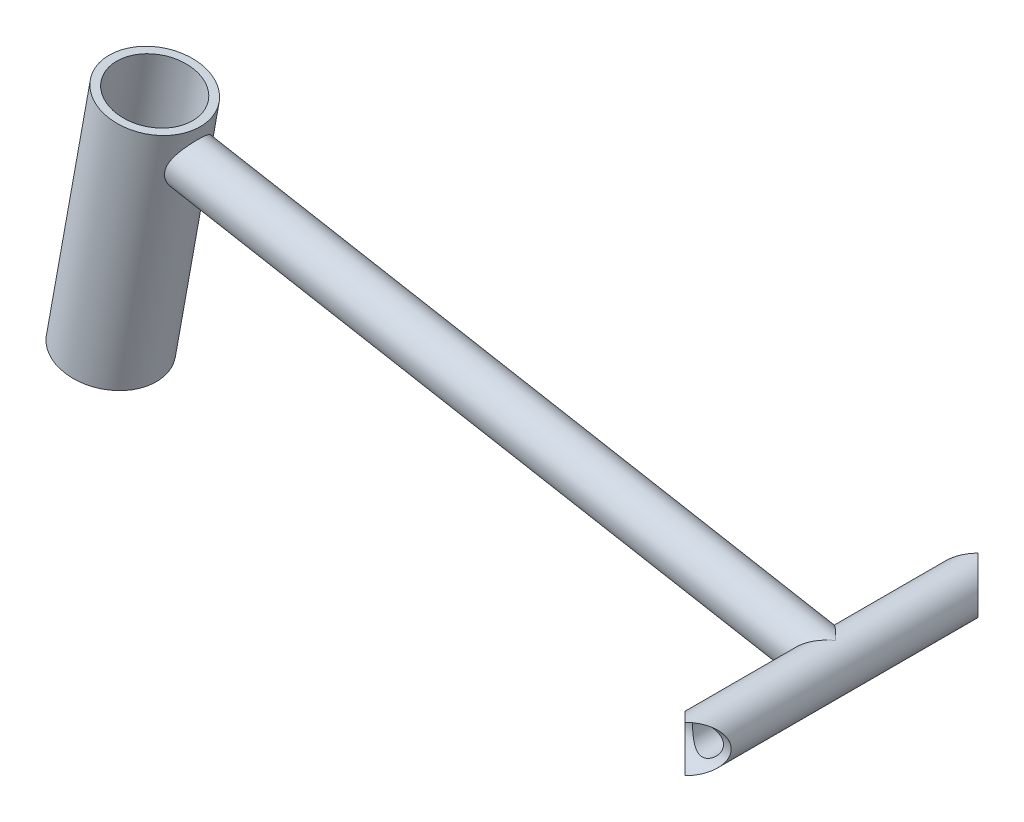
ISO-10303-21;
HEADER;
FILE_DESCRIPTION(('STEP AP214'),'2;1');
FILE_NAME('part.step','',(''),(''),'','','');
FILE_SCHEMA(('AUTOMOTIVE_DESIGN { 1 0 10303 214 1 1 1 1 }'));
ENDSEC;
DATA;
#1=APPLICATION_CONTEXT('core data for automotive mechanical design processes');
#2=APPLICATION_PROTOCOL_DEFINITION('international standard','automotive_design',2000,#1);
#3=PRODUCT_CONTEXT('',#1,'mechanical');
#4=PRODUCT('Part','Part','',(#3));
#5=PRODUCT_RELATED_PRODUCT_CATEGORY('part','',(#4));
#6=PRODUCT_DEFINITION_FORMATION('','',#4);
#7=PRODUCT_DEFINITION_CONTEXT('part definition',#1,'design');
#8=PRODUCT_DEFINITION('design','',#6,#7);
#9=PRODUCT_DEFINITION_SHAPE('','',#8);
#10=(LENGTH_UNIT() NAMED_UNIT(*) SI_UNIT(.MILLI.,.METRE.));
#11=(NAMED_UNIT(*) PLANE_ANGLE_UNIT() SI_UNIT($,.RADIAN.));
#12=(NAMED_UNIT(*) SI_UNIT($,.STERADIAN.) SOLID_ANGLE_UNIT());
#13=UNCERTAINTY_MEASURE_WITH_UNIT(LENGTH_MEASURE(1.E-05),#10,'distance_accuracy_value','');
#14=(GEOMETRIC_REPRESENTATION_CONTEXT(3) GLOBAL_UNCERTAINTY_ASSIGNED_CONTEXT((#13)) GLOBAL_UNIT_ASSIGNED_CONTEXT((#10,
#11,#12)) REPRESENTATION_CONTEXT('',''));
#15=CARTESIAN_POINT('',(0.,0.,0.));
#16=DIRECTION('',(0.,0.,1.));
#17=DIRECTION('',(1.,0.,0.));
#18=AXIS2_PLACEMENT_3D('',#15,#16,#17);
#19=CARTESIAN_POINT('',(0.,0.,95.));
#20=DIRECTION('',(0.,0.,-1.));
#21=DIRECTION('',(-1.,0.,0.));
#22=AXIS2_PLACEMENT_3D('',#19,#20,#21);
#23=CYLINDRICAL_SURFACE('',#22,10.);
#24=CARTESIAN_POINT('',(-10.,0.,-80.));
#25=CARTESIAN_POINT('',(-9.99999993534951,-0.25121602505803,-80.0000000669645));
#26=CARTESIAN_POINT('',(-9.99052094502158,-0.50243329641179,-80.0063243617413));
#27=CARTESIAN_POINT('',(-9.95275435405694,-1.00281430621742,-80.031462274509));
#28=CARTESIAN_POINT('',(-9.92446665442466,-1.25197803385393,-80.050275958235));
#29=CARTESIAN_POINT('',(-9.84950014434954,-1.74639437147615,-80.099937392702));
#30=CARTESIAN_POINT('',(-9.80281416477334,-1.99164541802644,-80.1307898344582));
#31=CARTESIAN_POINT('',(-9.69171976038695,-2.47636835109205,-80.2037950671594));
#32=CARTESIAN_POINT('',(-9.62731112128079,-2.71584016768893,-80.2459479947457));
#33=CARTESIAN_POINT('',(-9.48196024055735,-3.18634157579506,-80.3403774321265));
#34=CARTESIAN_POINT('',(-9.40109845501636,-3.41740603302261,-80.3926046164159));
#35=CARTESIAN_POINT('',(-9.22357931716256,-3.87103535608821,-80.5062163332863));
#36=CARTESIAN_POINT('',(-9.12692204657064,-4.09360026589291,-80.5676008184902));
#37=CARTESIAN_POINT('',(-8.91878234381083,-4.52919238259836,-80.6983175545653));
#38=CARTESIAN_POINT('',(-8.80730228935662,-4.74222111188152,-80.7676485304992));
#39=CARTESIAN_POINT('',(-8.57039192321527,-5.15806897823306,-80.913024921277));
#40=CARTESIAN_POINT('',(-8.44495641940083,-5.36088427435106,-80.9890728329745));
#41=CARTESIAN_POINT('',(-8.16988010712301,-5.77229179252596,-81.153204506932));
#42=CARTESIAN_POINT('',(-8.01908981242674,-5.97992610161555,-81.2417623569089));
#43=CARTESIAN_POINT('',(-7.70306611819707,-6.38186231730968,-81.4235310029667));
#44=CARTESIAN_POINT('',(-7.5378264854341,-6.57615840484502,-81.5167437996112));
#45=CARTESIAN_POINT('',(-7.19355182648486,-6.95109161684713,-81.7061483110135));
#46=CARTESIAN_POINT('',(-7.01449872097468,-7.13171020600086,-81.8023438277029));
#47=CARTESIAN_POINT('',(-6.64353733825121,-7.47849345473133,-81.9957106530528));
#48=CARTESIAN_POINT('',(-6.45163323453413,-7.64466276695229,-82.0928816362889));
#49=CARTESIAN_POINT('',(-6.02411381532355,-7.98727084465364,-82.3015816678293));
#50=CARTESIAN_POINT('',(-5.78638467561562,-8.16117931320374,-82.4129517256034));
#51=CARTESIAN_POINT('',(-5.29498288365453,-8.48824389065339,-82.6311530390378));
#52=CARTESIAN_POINT('',(-5.04130663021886,-8.64139528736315,-82.7379832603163));
#53=CARTESIAN_POINT('',(-4.51916377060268,-8.92554542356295,-82.9432463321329));
#54=CARTESIAN_POINT('',(-4.25072192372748,-9.05657983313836,-83.041692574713));
#55=CARTESIAN_POINT('',(-3.6995014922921,-9.2953668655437,-83.2263447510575));
#56=CARTESIAN_POINT('',(-3.41672239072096,-9.40311864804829,-83.3125502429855));
#57=CARTESIAN_POINT('',(-2.92197512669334,-9.56603073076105,-83.445835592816));
#58=CARTESIAN_POINT('',(-2.71313958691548,-9.62739262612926,-83.4970252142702));
#59=CARTESIAN_POINT('',(-2.28993727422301,-9.73672940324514,-83.5894246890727));
#60=CARTESIAN_POINT('',(-2.07557415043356,-9.78471288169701,-83.6306409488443));
#61=CARTESIAN_POINT('',(-1.6425809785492,-9.86663115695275,-83.7016578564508));
#62=CARTESIAN_POINT('',(-1.42395657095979,-9.90058335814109,-83.7314726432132));
#63=CARTESIAN_POINT('',(-0.983588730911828,-9.95398099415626,-83.778612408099));
#64=CARTESIAN_POINT('',(-0.761845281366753,-9.97342634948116,-83.7959373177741));
#65=CARTESIAN_POINT('',(-0.315986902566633,-9.99750949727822,-83.8174210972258));
#66=CARTESIAN_POINT('',(-0.0918659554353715,-10.0020856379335,-83.8215251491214));
#67=CARTESIAN_POINT('',(0.356015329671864,-9.9961699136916,-83.8162349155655));
#68=CARTESIAN_POINT('',(0.579775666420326,-9.98567799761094,-83.8068405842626));
#69=CARTESIAN_POINT('',(1.02531254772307,-9.94981025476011,-83.7749456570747));
#70=CARTESIAN_POINT('',(1.24708749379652,-9.92442336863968,-83.7524353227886));
#71=CARTESIAN_POINT('',(1.68688746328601,-9.85920094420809,-83.6952209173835));
#72=CARTESIAN_POINT('',(1.90491241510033,-9.81936513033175,-83.6605166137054));
#73=CARTESIAN_POINT('',(2.32630776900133,-9.72793320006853,-83.5819980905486));
#74=CARTESIAN_POINT('',(2.52989845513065,-9.67693962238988,-83.5386582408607));
#75=CARTESIAN_POINT('',(2.93162712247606,-9.56290804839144,-83.4433431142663));
#76=CARTESIAN_POINT('',(3.12976321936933,-9.49986594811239,-83.3913648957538));
#77=CARTESIAN_POINT('',(3.71496532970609,-9.29354494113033,-83.2245497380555));
#78=CARTESIAN_POINT('',(4.09304089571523,-9.13302364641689,-83.0987895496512));
#79=CARTESIAN_POINT('',(4.676143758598,-8.84272153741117,-82.8828714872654));
#80=CARTESIAN_POINT('',(4.89016265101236,-8.72612786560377,-82.7984612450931));
#81=CARTESIAN_POINT('',(5.30787405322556,-8.47852404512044,-82.6251282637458));
#82=CARTESIAN_POINT('',(5.51156558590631,-8.34751253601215,-82.5362050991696));
#83=CARTESIAN_POINT('',(5.90837865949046,-8.07152743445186,-82.3557259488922));
#84=CARTESIAN_POINT('',(6.10148824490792,-7.92653854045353,-82.2641671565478));
#85=CARTESIAN_POINT('',(6.47652189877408,-7.6231772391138,-82.0803005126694));
#86=CARTESIAN_POINT('',(6.658445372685,-7.46480412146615,-81.9879926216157));
#87=CARTESIAN_POINT('',(7.04865159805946,-7.09947419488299,-81.7844751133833));
#88=CARTESIAN_POINT('',(7.25415168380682,-6.88940798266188,-81.673484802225));
#89=CARTESIAN_POINT('',(7.64687567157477,-6.45073383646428,-81.4557017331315));
#90=CARTESIAN_POINT('',(7.83409620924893,-6.22212250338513,-81.3489097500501));
#91=CARTESIAN_POINT('',(8.18875916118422,-5.74734305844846,-81.1423299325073));
#92=CARTESIAN_POINT('',(8.35621606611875,-5.50118802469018,-81.0425369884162));
#93=CARTESIAN_POINT('',(8.6698826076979,-4.99223677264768,-80.852516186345));
#94=CARTESIAN_POINT('',(8.81609809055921,-4.72944516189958,-80.7622856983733));
#95=CARTESIAN_POINT('',(9.05909913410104,-4.24166531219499,-80.6104153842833));
#96=CARTESIAN_POINT('',(9.15995597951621,-4.01936273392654,-80.5466380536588));
#97=CARTESIAN_POINT('',(9.34581764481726,-3.5659086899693,-80.4281374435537));
#98=CARTESIAN_POINT('',(9.43082544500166,-3.3347588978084,-80.3734124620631));
#99=CARTESIAN_POINT('',(9.58399689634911,-2.86496136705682,-80.2741861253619));
#100=CARTESIAN_POINT('',(9.65217126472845,-2.6263185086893,-80.2296782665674));
#101=CARTESIAN_POINT('',(9.7708761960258,-2.14287716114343,-80.1518347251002));
#102=CARTESIAN_POINT('',(9.82140648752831,-1.89807857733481,-80.11849921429));
#103=CARTESIAN_POINT('',(9.90428665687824,-1.40298657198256,-80.0636710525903));
#104=CARTESIAN_POINT('',(9.9365560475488,-1.15267379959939,-80.0422308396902));
#105=CARTESIAN_POINT('',(9.98207727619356,-0.649559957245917,-80.0119521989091));
#106=CARTESIAN_POINT('',(9.99532908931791,-0.396758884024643,-80.0031137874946));
#107=CARTESIAN_POINT('',(10.0026040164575,0.109232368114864,-79.9982641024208));
#108=CARTESIAN_POINT('',(9.99662792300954,0.362422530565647,-80.0022523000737));
#109=CARTESIAN_POINT('',(9.96554372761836,0.867090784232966,-80.0229533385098));
#110=CARTESIAN_POINT('',(9.94043644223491,1.11856894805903,-80.0396656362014));
#111=CARTESIAN_POINT('',(9.8739156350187,1.60021088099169,-80.0837792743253));
#112=CARTESIAN_POINT('',(9.83377417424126,1.83062905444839,-80.1103454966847));
#113=CARTESIAN_POINT('',(9.73781705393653,2.286750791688,-80.173544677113));
#114=CARTESIAN_POINT('',(9.6820022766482,2.51245462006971,-80.2101770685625));
#115=CARTESIAN_POINT('',(9.55535953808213,2.95782054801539,-80.2927707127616));
#116=CARTESIAN_POINT('',(9.48453312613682,3.17748326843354,-80.3387310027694));
#117=CARTESIAN_POINT('',(9.3285826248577,3.609760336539,-80.4391314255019));
#118=CARTESIAN_POINT('',(9.24345297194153,3.82237190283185,-80.4935748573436));
#119=CARTESIAN_POINT('',(9.05417659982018,4.25209030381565,-80.6134635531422));
#120=CARTESIAN_POINT('',(8.94919430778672,4.4686990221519,-80.6793734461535));
#121=CARTESIAN_POINT('',(8.72496139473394,4.89208194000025,-80.8184199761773));
#122=CARTESIAN_POINT('',(8.60570480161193,5.0988519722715,-80.8915596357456));
#123=CARTESIAN_POINT('',(8.35381209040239,5.50184549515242,-81.0437790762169));
#124=CARTESIAN_POINT('',(8.2211726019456,5.69806630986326,-81.122860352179));
#125=CARTESIAN_POINT('',(7.94333478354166,6.07939950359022,-81.2856319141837));
#126=CARTESIAN_POINT('',(7.79813505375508,6.26451064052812,-81.3693227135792));
#127=CARTESIAN_POINT('',(7.47194619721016,6.65160325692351,-81.5534730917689));
#128=CARTESIAN_POINT('',(7.28893046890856,6.85161533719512,-81.6544896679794));
#129=CARTESIAN_POINT('',(6.90796479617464,7.23554778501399,-81.8586865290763));
#130=CARTESIAN_POINT('',(6.71001803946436,7.41947156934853,-81.9618663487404));
#131=CARTESIAN_POINT('',(6.29970117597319,7.77089399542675,-82.168213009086));
#132=CARTESIAN_POINT('',(6.08731892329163,7.93837850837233,-82.2713797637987));
#133=CARTESIAN_POINT('',(5.64888230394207,8.25611378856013,-82.4751369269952));
#134=CARTESIAN_POINT('',(5.42282933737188,8.406366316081,-82.5757275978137));
#135=CARTESIAN_POINT('',(4.97724137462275,8.67693135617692,-82.7633488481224));
#136=CARTESIAN_POINT('',(4.75877148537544,8.798701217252,-82.8508068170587));
#137=CARTESIAN_POINT('',(4.31122260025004,9.02642731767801,-83.0190296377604));
#138=CARTESIAN_POINT('',(4.08214345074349,9.13238332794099,-83.0997943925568));
#139=CARTESIAN_POINT('',(3.61433071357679,9.32741855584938,-83.2520404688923));
#140=CARTESIAN_POINT('',(3.37561188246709,9.4165224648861,-83.3235353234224));
#141=CARTESIAN_POINT('',(2.88913740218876,9.57697422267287,-83.4547704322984));
#142=CARTESIAN_POINT('',(2.64138384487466,9.64832615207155,-83.5145133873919));
#143=CARTESIAN_POINT('',(2.18348283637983,9.76102279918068,-83.6102295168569));
#144=CARTESIAN_POINT('',(1.97458281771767,9.80545611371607,-83.6485451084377));
#145=CARTESIAN_POINT('',(1.55271682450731,9.8810407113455,-83.7142765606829));
#146=CARTESIAN_POINT('',(1.33975168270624,9.91219468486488,-83.7416946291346));
#147=CARTESIAN_POINT('',(0.911245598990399,9.96072687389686,-83.7846098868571));
#148=CARTESIAN_POINT('',(0.695707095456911,9.97811721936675,-83.8001175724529));
#149=CARTESIAN_POINT('',(0.263409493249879,9.99887192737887,-83.8186424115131));
#150=CARTESIAN_POINT('',(0.0466503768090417,10.0022360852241,-83.8216593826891));
#151=CARTESIAN_POINT('',(-0.386557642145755,9.99487528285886,-83.8150775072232));
#152=CARTESIAN_POINT('',(-0.603006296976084,9.98414227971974,-83.805471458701));
#153=CARTESIAN_POINT('',(-1.03385131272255,9.94876260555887,-83.7740177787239));
#154=CARTESIAN_POINT('',(-1.24824769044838,9.92411604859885,-83.7521702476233));
#155=CARTESIAN_POINT('',(-1.67374366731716,9.86128176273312,-83.6970418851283));
#156=CARTESIAN_POINT('',(-1.88484006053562,9.82308162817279,-83.6637505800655));
#157=CARTESIAN_POINT('',(-2.30244876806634,9.73367199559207,-83.5868892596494));
#158=CARTESIAN_POINT('',(-2.50895838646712,9.68245505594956,-83.5433133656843));
#159=CARTESIAN_POINT('',(-2.97060688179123,9.55234495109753,-83.4344611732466));
#160=CARTESIAN_POINT('',(-3.22406270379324,9.46971376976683,-83.3664959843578));
#161=CARTESIAN_POINT('',(-3.72072127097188,9.28581809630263,-83.2191916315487));
#162=CARTESIAN_POINT('',(-3.96392044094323,9.18454717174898,-83.1398485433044));
#163=CARTESIAN_POINT('',(-4.43942989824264,8.96438401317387,-82.9725752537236));
#164=CARTESIAN_POINT('',(-4.67172859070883,8.84547355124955,-82.8846362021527));
#165=CARTESIAN_POINT('',(-5.12459249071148,8.59104253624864,-82.7029098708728));
#166=CARTESIAN_POINT('',(-5.34515831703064,8.45552286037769,-82.6091229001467));
#167=CARTESIAN_POINT('',(-5.7779814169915,8.16602291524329,-82.4164056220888));
#168=CARTESIAN_POINT('',(-5.99001811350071,8.01175463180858,-82.3174131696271));
#169=CARTESIAN_POINT('',(-6.40107008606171,7.68731964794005,-82.1181766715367));
#170=CARTESIAN_POINT('',(-6.60008043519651,7.51714699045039,-82.0179321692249));
#171=CARTESIAN_POINT('',(-6.98443549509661,7.16144037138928,-81.8183702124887));
#172=CARTESIAN_POINT('',(-7.16977822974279,6.97590419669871,-81.7190528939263));
#173=CARTESIAN_POINT('',(-7.5260207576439,6.58999024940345,-81.5233966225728));
#174=CARTESIAN_POINT('',(-7.69692069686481,6.38961262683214,-81.4270576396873));
#175=CARTESIAN_POINT('',(-8.04688641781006,5.94464767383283,-81.2257836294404));
#176=CARTESIAN_POINT('',(-8.22358940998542,5.69784749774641,-81.1216060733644));
#177=CARTESIAN_POINT('',(-8.55531270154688,5.18647351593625,-80.9225080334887));
#178=CARTESIAN_POINT('',(-8.71032983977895,4.92189712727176,-80.8275888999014));
#179=CARTESIAN_POINT('',(-8.99660521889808,4.37672916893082,-80.6498665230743));
#180=CARTESIAN_POINT('',(-9.12789261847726,4.09615781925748,-80.5670484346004));
#181=CARTESIAN_POINT('',(-9.36490865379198,3.52068543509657,-80.4159961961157));
#182=CARTESIAN_POINT('',(-9.47064626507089,3.22578947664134,-80.3477569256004));
#183=CARTESIAN_POINT('',(-9.63420014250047,2.69111020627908,-80.2414473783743));
#184=CARTESIAN_POINT('',(-9.69744389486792,2.45363501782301,-80.2000427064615));
#185=CARTESIAN_POINT('',(-9.8065080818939,1.97308581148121,-80.1283523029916));
#186=CARTESIAN_POINT('',(-9.85233185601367,1.73001287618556,-80.098064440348));
#187=CARTESIAN_POINT('',(-9.92589668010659,1.24011776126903,-80.0493255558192));
#188=CARTESIAN_POINT('',(-9.95364860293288,0.993297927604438,-80.0308674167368));
#189=CARTESIAN_POINT('',(-9.9907006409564,0.497652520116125,-80.006204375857));
#190=CARTESIAN_POINT('',(-10.0000000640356,0.248826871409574,-79.9999999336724));
#191=CARTESIAN_POINT('',(-10.,0.,-80.));
#192=B_SPLINE_CURVE_WITH_KNOTS('',3,(#24,#25,#26,#27,#28,#29,#30,#31,#32,#33,#34,#35,#36,#37,
#38,#39,#40,#41,#42,#43,#44,#45,#46,#47,#48,#49,#50,#51,#52,#53,#54,#55,#56,#57,#58,#59,#60,#61,
#62,#63,#64,#65,#66,#67,#68,#69,#70,#71,#72,#73,#74,#75,#76,#77,#78,#79,#80,#81,#82,#83,#84,#85,
#86,#87,#88,#89,#90,#91,#92,#93,#94,#95,#96,#97,#98,#99,#100,#101,#102,#103,#104,#105,#106,#107,
#108,#109,#110,#111,#112,#113,#114,#115,#116,#117,#118,#119,#120,#121,#122,#123,#124,#125,#126,
#127,#128,#129,#130,#131,#132,#133,#134,#135,#136,#137,#138,#139,#140,#141,#142,#143,#144,#145,
#146,#147,#148,#149,#150,#151,#152,#153,#154,#155,#156,#157,#158,#159,#160,#161,#162,#163,#164,
#165,#166,#167,#168,#169,#170,#171,#172,#173,#174,#175,#176,#177,#178,#179,#180,#181,#182,#183,
#184,#185,#186,#187,#188,#189,#190,#191),.UNSPECIFIED.,.T.,.F.,(4,2,2,2,2,2,2,2,2,2,2,2,2,2,2,2,
2,2,2,2,2,2,2,2,2,2,2,2,2,2,2,2,2,2,2,2,2,2,2,2,2,2,2,2,2,2,2,2,2,2,2,2,2,2,2,2,2,2,2,2,2,2,2,2,
2,2,2,2,2,2,2,2,2,2,2,2,2,2,2,2,2,2,2,4),(0.,0.753394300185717,1.50679256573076,2.2604846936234,
3.0141859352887,3.76428651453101,4.51438321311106,5.26435973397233,6.01461622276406,
6.82821436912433,7.64216523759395,8.45720010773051,9.27197155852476,10.2155659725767,
11.159374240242,12.1016454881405,13.0439507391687,13.7141436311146,14.3839048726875,
15.0528328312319,15.7217644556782,16.3934661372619,17.0651701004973,17.7373734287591,
18.4095895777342,19.0518780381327,19.694385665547,20.9787317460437,21.7519790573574,
22.5252993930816,23.2994761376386,24.0736939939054,25.0149715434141,25.956422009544,
26.8971778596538,27.8376742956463,28.5938374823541,29.3498583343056,30.1053966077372,
30.8609465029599,31.6198011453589,32.3786567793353,33.1374811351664,33.896273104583,
34.6016588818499,35.3070049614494,36.0122782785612,36.7178265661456,37.4657892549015,
38.2140659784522,38.9625316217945,39.7110807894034,40.5781485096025,41.4450316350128,
42.3126534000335,43.1801864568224,43.9743636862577,44.7685524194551,45.5615683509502,
46.3544018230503,47.0046896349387,47.6548456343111,48.3044280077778,48.9540198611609,
49.6039824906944,50.2539397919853,50.9044935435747,51.5554200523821,52.3795636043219,
53.203992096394,54.0292785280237,54.8545213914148,55.6945962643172,56.534987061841,
57.3754991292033,58.2160027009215,59.1774341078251,60.1390055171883,61.0993872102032,
62.0594310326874,62.8062251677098,63.5528760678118,64.2990773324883,65.045306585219),.UNSPECIFIED.);
#193=CARTESIAN_POINT('',(-10.,0.,-80.));
#194=VERTEX_POINT('',#193);
#195=EDGE_CURVE('E74',#194,#194,#192,.T.);
#196=ORIENTED_EDGE('',*,*,#195,.F.);
#197=EDGE_LOOP('',(#196));
#198=FACE_BOUND('',#197,.T.);
#199=CARTESIAN_POINT('',(-10.,0.,80.));
#200=CARTESIAN_POINT('',(-9.99999993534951,-0.25121602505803,80.0000000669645));
#201=CARTESIAN_POINT('',(-9.99052094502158,-0.502433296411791,80.0063243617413));
#202=CARTESIAN_POINT('',(-9.95275435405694,-1.00281430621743,80.0314622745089));
#203=CARTESIAN_POINT('',(-9.92446665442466,-1.25197803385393,80.050275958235));
#204=CARTESIAN_POINT('',(-9.84950014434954,-1.74639437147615,80.0999373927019));
#205=CARTESIAN_POINT('',(-9.80281416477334,-1.99164541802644,80.1307898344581));
#206=CARTESIAN_POINT('',(-9.69171976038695,-2.47636835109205,80.2037950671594));
#207=CARTESIAN_POINT('',(-9.62731112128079,-2.71584016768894,80.2459479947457));
#208=CARTESIAN_POINT('',(-9.48196024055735,-3.18634157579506,80.3403774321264));
#209=CARTESIAN_POINT('',(-9.40109845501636,-3.41740603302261,80.3926046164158));
#210=CARTESIAN_POINT('',(-9.22357931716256,-3.87103535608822,80.5062163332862));
#211=CARTESIAN_POINT('',(-9.12692204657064,-4.09360026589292,80.5676008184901));
#212=CARTESIAN_POINT('',(-8.91878234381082,-4.52919238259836,80.6983175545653));
#213=CARTESIAN_POINT('',(-8.80730228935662,-4.74222111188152,80.7676485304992));
#214=CARTESIAN_POINT('',(-8.57039192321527,-5.15806897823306,80.9130249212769));
#215=CARTESIAN_POINT('',(-8.44495641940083,-5.36088427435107,80.9890728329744));
#216=CARTESIAN_POINT('',(-8.16988010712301,-5.77229179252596,81.153204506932));
#217=CARTESIAN_POINT('',(-8.01908981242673,-5.97992610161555,81.2417623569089));
#218=CARTESIAN_POINT('',(-7.70306611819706,-6.38186231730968,81.4235310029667));
#219=CARTESIAN_POINT('',(-7.53782648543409,-6.57615840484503,81.5167437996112));
#220=CARTESIAN_POINT('',(-7.19355182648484,-6.95109161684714,81.7061483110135));
#221=CARTESIAN_POINT('',(-7.01449872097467,-7.13171020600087,81.8023438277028));
#222=CARTESIAN_POINT('',(-6.6435373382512,-7.47849345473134,81.9957106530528));
#223=CARTESIAN_POINT('',(-6.45163323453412,-7.64466276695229,82.0928816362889));
#224=CARTESIAN_POINT('',(-6.02411381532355,-7.98727084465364,82.3015816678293));
#225=CARTESIAN_POINT('',(-5.78638467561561,-8.16117931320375,82.4129517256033));
#226=CARTESIAN_POINT('',(-5.29498288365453,-8.48824389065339,82.6311530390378));
#227=CARTESIAN_POINT('',(-5.04130663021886,-8.64139528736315,82.7379832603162));
#228=CARTESIAN_POINT('',(-4.51916377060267,-8.92554542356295,82.9432463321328));
#229=CARTESIAN_POINT('',(-4.25072192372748,-9.05657983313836,83.041692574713));
#230=CARTESIAN_POINT('',(-3.6995014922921,-9.2953668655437,83.2263447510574));
#231=CARTESIAN_POINT('',(-3.41672239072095,-9.4031186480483,83.3125502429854));
#232=CARTESIAN_POINT('',(-2.92197512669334,-9.56603073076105,83.445835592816));
#233=CARTESIAN_POINT('',(-2.71313958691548,-9.62739262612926,83.4970252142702));
#234=CARTESIAN_POINT('',(-2.289937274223,-9.73672940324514,83.5894246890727));
#235=CARTESIAN_POINT('',(-2.07557415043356,-9.78471288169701,83.6306409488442));
#236=CARTESIAN_POINT('',(-1.64258097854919,-9.86663115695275,83.7016578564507));
#237=CARTESIAN_POINT('',(-1.42395657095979,-9.90058335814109,83.7314726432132));
#238=CARTESIAN_POINT('',(-0.983588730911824,-9.95398099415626,83.778612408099));
#239=CARTESIAN_POINT('',(-0.761845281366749,-9.97342634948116,83.795937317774));
#240=CARTESIAN_POINT('',(-0.315986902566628,-9.99750949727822,83.8174210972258));
#241=CARTESIAN_POINT('',(-0.0918659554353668,-10.0020856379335,83.8215251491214));
#242=CARTESIAN_POINT('',(0.356015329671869,-9.9961699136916,83.8162349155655));
#243=CARTESIAN_POINT('',(0.579775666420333,-9.98567799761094,83.8068405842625));
#244=CARTESIAN_POINT('',(1.02531254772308,-9.94981025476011,83.7749456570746));
#245=CARTESIAN_POINT('',(1.24708749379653,-9.92442336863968,83.7524353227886));
#246=CARTESIAN_POINT('',(1.68688746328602,-9.85920094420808,83.6952209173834));
#247=CARTESIAN_POINT('',(1.90491241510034,-9.81936513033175,83.6605166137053));
#248=CARTESIAN_POINT('',(2.32630776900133,-9.72793320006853,83.5819980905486));
#249=CARTESIAN_POINT('',(2.52989845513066,-9.67693962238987,83.5386582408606));
#250=CARTESIAN_POINT('',(2.93162712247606,-9.56290804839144,83.4433431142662));
#251=CARTESIAN_POINT('',(3.12976321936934,-9.49986594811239,83.3913648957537));
#252=CARTESIAN_POINT('',(3.7149653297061,-9.29354494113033,83.2245497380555));
#253=CARTESIAN_POINT('',(4.09304089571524,-9.13302364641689,83.0987895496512));
#254=CARTESIAN_POINT('',(4.67614375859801,-8.84272153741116,82.8828714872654));
#255=CARTESIAN_POINT('',(4.89016265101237,-8.72612786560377,82.7984612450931));
#256=CARTESIAN_POINT('',(5.30787405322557,-8.47852404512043,82.6251282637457));
#257=CARTESIAN_POINT('',(5.51156558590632,-8.34751253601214,82.5362050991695));
#258=CARTESIAN_POINT('',(5.90837865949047,-8.07152743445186,82.3557259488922));
#259=CARTESIAN_POINT('',(6.10148824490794,-7.92653854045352,82.2641671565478));
#260=CARTESIAN_POINT('',(6.47652189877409,-7.62317723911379,82.0803005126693));
#261=CARTESIAN_POINT('',(6.65844537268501,-7.46480412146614,81.9879926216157));
#262=CARTESIAN_POINT('',(7.04865159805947,-7.09947419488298,81.7844751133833));
#263=CARTESIAN_POINT('',(7.25415168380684,-6.88940798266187,81.6734848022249));
#264=CARTESIAN_POINT('',(7.64687567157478,-6.45073383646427,81.4557017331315));
#265=CARTESIAN_POINT('',(7.83409620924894,-6.22212250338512,81.3489097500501));
#266=CARTESIAN_POINT('',(8.18875916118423,-5.74734305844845,81.1423299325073));
#267=CARTESIAN_POINT('',(8.35621606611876,-5.50118802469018,81.0425369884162));
#268=CARTESIAN_POINT('',(8.66988260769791,-4.99223677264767,80.8525161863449));
#269=CARTESIAN_POINT('',(8.81609809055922,-4.72944516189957,80.7622856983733));
#270=CARTESIAN_POINT('',(9.05909913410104,-4.24166531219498,80.6104153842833));
#271=CARTESIAN_POINT('',(9.15995597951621,-4.01936273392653,80.5466380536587));
#272=CARTESIAN_POINT('',(9.34581764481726,-3.56590868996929,80.4281374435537));
#273=CARTESIAN_POINT('',(9.43082544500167,-3.33475889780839,80.373412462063));
#274=CARTESIAN_POINT('',(9.58399689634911,-2.86496136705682,80.2741861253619));
#275=CARTESIAN_POINT('',(9.65217126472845,-2.62631850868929,80.2296782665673));
#276=CARTESIAN_POINT('',(9.77087619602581,-2.14287716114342,80.1518347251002));
#277=CARTESIAN_POINT('',(9.82140648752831,-1.89807857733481,80.11849921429));
#278=CARTESIAN_POINT('',(9.90428665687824,-1.40298657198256,80.0636710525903));
#279=CARTESIAN_POINT('',(9.9365560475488,-1.15267379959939,80.0422308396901));
#280=CARTESIAN_POINT('',(9.98207727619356,-0.64955995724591,80.011952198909));
#281=CARTESIAN_POINT('',(9.99532908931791,-0.396758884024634,80.0031137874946));
#282=CARTESIAN_POINT('',(10.0026040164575,0.109232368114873,79.9982641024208));
#283=CARTESIAN_POINT('',(9.99662792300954,0.362422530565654,80.0022523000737));
#284=CARTESIAN_POINT('',(9.96554372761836,0.867090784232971,80.0229533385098));
#285=CARTESIAN_POINT('',(9.94043644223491,1.11856894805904,80.0396656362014));
#286=CARTESIAN_POINT('',(9.8739156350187,1.60021088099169,80.0837792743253));
#287=CARTESIAN_POINT('',(9.83377417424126,1.83062905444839,80.1103454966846));
#288=CARTESIAN_POINT('',(9.73781705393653,2.286750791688,80.1735446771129));
#289=CARTESIAN_POINT('',(9.6820022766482,2.51245462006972,80.2101770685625));
#290=CARTESIAN_POINT('',(9.55535953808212,2.9578205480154,80.2927707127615));
#291=CARTESIAN_POINT('',(9.48453312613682,3.17748326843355,80.3387310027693));
#292=CARTESIAN_POINT('',(9.32858262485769,3.60976033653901,80.4391314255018));
#293=CARTESIAN_POINT('',(9.24345297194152,3.82237190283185,80.4935748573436));
#294=CARTESIAN_POINT('',(9.05417659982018,4.25209030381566,80.6134635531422));
#295=CARTESIAN_POINT('',(8.94919430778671,4.46869902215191,80.6793734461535));
#296=CARTESIAN_POINT('',(8.72496139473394,4.89208194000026,80.8184199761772));
#297=CARTESIAN_POINT('',(8.60570480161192,5.09885197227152,80.8915596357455));
#298=CARTESIAN_POINT('',(8.35381209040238,5.50184549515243,81.0437790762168));
#299=CARTESIAN_POINT('',(8.22117260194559,5.69806630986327,81.122860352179));
#300=CARTESIAN_POINT('',(7.94333478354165,6.07939950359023,81.2856319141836));
#301=CARTESIAN_POINT('',(7.79813505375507,6.26451064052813,81.3693227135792));
#302=CARTESIAN_POINT('',(7.47194619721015,6.65160325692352,81.5534730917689));
#303=CARTESIAN_POINT('',(7.28893046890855,6.85161533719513,81.6544896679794));
#304=CARTESIAN_POINT('',(6.90796479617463,7.23554778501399,81.8586865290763));
#305=CARTESIAN_POINT('',(6.71001803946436,7.41947156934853,81.9618663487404));
#306=CARTESIAN_POINT('',(6.29970117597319,7.77089399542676,82.168213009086));
#307=CARTESIAN_POINT('',(6.08731892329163,7.93837850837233,82.2713797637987));
#308=CARTESIAN_POINT('',(5.64888230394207,8.25611378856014,82.4751369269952));
#309=CARTESIAN_POINT('',(5.42282933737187,8.40636631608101,82.5757275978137));
#310=CARTESIAN_POINT('',(4.97724137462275,8.67693135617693,82.7633488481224));
#311=CARTESIAN_POINT('',(4.75877148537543,8.798701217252,82.8508068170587));
#312=CARTESIAN_POINT('',(4.31122260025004,9.02642731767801,83.0190296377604));
#313=CARTESIAN_POINT('',(4.08214345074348,9.13238332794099,83.0997943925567));
#314=CARTESIAN_POINT('',(3.61433071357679,9.32741855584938,83.2520404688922));
#315=CARTESIAN_POINT('',(3.37561188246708,9.4165224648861,83.3235353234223));
#316=CARTESIAN_POINT('',(2.88913740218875,9.57697422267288,83.4547704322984));
#317=CARTESIAN_POINT('',(2.64138384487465,9.64832615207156,83.5145133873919));
#318=CARTESIAN_POINT('',(2.18348283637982,9.76102279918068,83.6102295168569));
#319=CARTESIAN_POINT('',(1.97458281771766,9.80545611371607,83.6485451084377));
#320=CARTESIAN_POINT('',(1.5527168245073,9.88104071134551,83.7142765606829));
#321=CARTESIAN_POINT('',(1.33975168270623,9.91219468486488,83.7416946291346));
#322=CARTESIAN_POINT('',(0.911245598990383,9.96072687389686,83.7846098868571));
#323=CARTESIAN_POINT('',(0.695707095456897,9.97811721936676,83.8001175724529));
#324=CARTESIAN_POINT('',(0.263409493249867,9.99887192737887,83.8186424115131));
#325=CARTESIAN_POINT('',(0.04665037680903,10.0022360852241,83.821659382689));
#326=CARTESIAN_POINT('',(-0.386557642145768,9.99487528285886,83.8150775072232));
#327=CARTESIAN_POINT('',(-0.603006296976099,9.98414227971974,83.8054714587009));
#328=CARTESIAN_POINT('',(-1.03385131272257,9.94876260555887,83.7740177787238));
#329=CARTESIAN_POINT('',(-1.24824769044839,9.92411604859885,83.7521702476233));
#330=CARTESIAN_POINT('',(-1.67374366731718,9.86128176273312,83.6970418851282));
#331=CARTESIAN_POINT('',(-1.88484006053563,9.82308162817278,83.6637505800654));
#332=CARTESIAN_POINT('',(-2.30244876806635,9.73367199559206,83.5868892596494));
#333=CARTESIAN_POINT('',(-2.50895838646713,9.68245505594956,83.5433133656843));
#334=CARTESIAN_POINT('',(-2.97060688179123,9.55234495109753,83.4344611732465));
#335=CARTESIAN_POINT('',(-3.22406270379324,9.46971376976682,83.3664959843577));
#336=CARTESIAN_POINT('',(-3.72072127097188,9.28581809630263,83.2191916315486));
#337=CARTESIAN_POINT('',(-3.96392044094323,9.18454717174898,83.1398485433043));
#338=CARTESIAN_POINT('',(-4.43942989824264,8.96438401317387,82.9725752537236));
#339=CARTESIAN_POINT('',(-4.67172859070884,8.84547355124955,82.8846362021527));
#340=CARTESIAN_POINT('',(-5.12459249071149,8.59104253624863,82.7029098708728));
#341=CARTESIAN_POINT('',(-5.34515831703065,8.45552286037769,82.6091229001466));
#342=CARTESIAN_POINT('',(-5.7779814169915,8.16602291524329,82.4164056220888));
#343=CARTESIAN_POINT('',(-5.99001811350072,8.01175463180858,82.3174131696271));
#344=CARTESIAN_POINT('',(-6.40107008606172,7.68731964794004,82.1181766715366));
#345=CARTESIAN_POINT('',(-6.60008043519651,7.51714699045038,82.0179321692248));
#346=CARTESIAN_POINT('',(-6.98443549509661,7.16144037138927,81.8183702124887));
#347=CARTESIAN_POINT('',(-7.1697782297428,6.97590419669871,81.7190528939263));
#348=CARTESIAN_POINT('',(-7.52602075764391,6.58999024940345,81.5233966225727));
#349=CARTESIAN_POINT('',(-7.69692069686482,6.38961262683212,81.4270576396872));
#350=CARTESIAN_POINT('',(-8.04688641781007,5.94464767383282,81.2257836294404));
#351=CARTESIAN_POINT('',(-8.22358940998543,5.6978474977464,81.1216060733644));
#352=CARTESIAN_POINT('',(-8.55531270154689,5.18647351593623,80.9225080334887));
#353=CARTESIAN_POINT('',(-8.71032983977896,4.92189712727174,80.8275888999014));
#354=CARTESIAN_POINT('',(-8.99660521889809,4.3767291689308,80.6498665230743));
#355=CARTESIAN_POINT('',(-9.12789261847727,4.09615781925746,80.5670484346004));
#356=CARTESIAN_POINT('',(-9.36490865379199,3.52068543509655,80.4159961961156));
#357=CARTESIAN_POINT('',(-9.47064626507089,3.22578947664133,80.3477569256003));
#358=CARTESIAN_POINT('',(-9.63420014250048,2.69111020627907,80.2414473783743));
#359=CARTESIAN_POINT('',(-9.69744389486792,2.453635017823,80.2000427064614));
#360=CARTESIAN_POINT('',(-9.8065080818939,1.97308581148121,80.1283523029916));
#361=CARTESIAN_POINT('',(-9.85233185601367,1.73001287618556,80.0980644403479));
#362=CARTESIAN_POINT('',(-9.92589668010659,1.24011776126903,80.0493255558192));
#363=CARTESIAN_POINT('',(-9.95364860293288,0.993297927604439,80.0308674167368));
#364=CARTESIAN_POINT('',(-9.9907006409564,0.497652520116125,80.006204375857));
#365=CARTESIAN_POINT('',(-10.0000000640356,0.248826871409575,79.9999999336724));
#366=CARTESIAN_POINT('',(-10.,0.,80.));
#367=B_SPLINE_CURVE_WITH_KNOTS('',3,(#199,#200,#201,#202,#203,#204,#205,#206,#207,#208,#209,
#210,#211,#212,#213,#214,#215,#216,#217,#218,#219,#220,#221,#222,#223,#224,#225,#226,#227,#228,
#229,#230,#231,#232,#233,#234,#235,#236,#237,#238,#239,#240,#241,#242,#243,#244,#245,#246,#247,
#248,#249,#250,#251,#252,#253,#254,#255,#256,#257,#258,#259,#260,#261,#262,#263,#264,#265,#266,
#267,#268,#269,#270,#271,#272,#273,#274,#275,#276,#277,#278,#279,#280,#281,#282,#283,#284,#285,
#286,#287,#288,#289,#290,#291,#292,#293,#294,#295,#296,#297,#298,#299,#300,#301,#302,#303,#304,
#305,#306,#307,#308,#309,#310,#311,#312,#313,#314,#315,#316,#317,#318,#319,#320,#321,#322,#323,
#324,#325,#326,#327,#328,#329,#330,#331,#332,#333,#334,#335,#336,#337,#338,#339,#340,#341,#342,
#343,#344,#345,#346,#347,#348,#349,#350,#351,#352,#353,#354,#355,#356,#357,#358,#359,#360,#361,
#362,#363,#364,#365,#366),.UNSPECIFIED.,.T.,.F.,(4,2,2,2,2,2,2,2,2,2,2,2,2,2,2,2,2,2,2,2,2,2,2,
2,2,2,2,2,2,2,2,2,2,2,2,2,2,2,2,2,2,2,2,2,2,2,2,2,2,2,2,2,2,2,2,2,2,2,2,2,2,2,2,2,2,2,2,2,2,2,2,
2,2,2,2,2,2,2,2,2,2,2,2,4),(0.,0.753394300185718,1.50679256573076,2.2604846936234,
3.0141859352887,3.76428651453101,4.51438321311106,5.26435973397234,6.01461622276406,
6.82821436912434,7.64216523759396,8.45720010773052,9.27197155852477,10.2155659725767,
11.159374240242,12.1016454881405,13.0439507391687,13.7141436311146,14.3839048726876,
15.0528328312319,15.7217644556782,16.3934661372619,17.0651701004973,17.7373734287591,
18.4095895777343,19.0518780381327,19.694385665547,20.9787317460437,21.7519790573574,
22.5252993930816,23.2994761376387,24.0736939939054,25.0149715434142,25.956422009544,
26.8971778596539,27.8376742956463,28.5938374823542,29.3498583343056,30.1053966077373,
30.8609465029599,31.6198011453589,32.3786567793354,33.1374811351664,33.896273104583,
34.6016588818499,35.3070049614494,36.0122782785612,36.7178265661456,37.4657892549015,
38.2140659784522,38.9625316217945,39.7110807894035,40.5781485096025,41.4450316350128,
42.3126534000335,43.1801864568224,43.9743636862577,44.7685524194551,45.5615683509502,
46.3544018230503,47.0046896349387,47.6548456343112,48.3044280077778,48.9540198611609,
49.6039824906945,50.2539397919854,50.9044935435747,51.5554200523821,52.3795636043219,
53.2039920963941,54.0292785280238,54.8545213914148,55.6945962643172,56.534987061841,
57.3754991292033,58.2160027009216,59.1774341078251,60.1390055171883,61.0993872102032,
62.0594310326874,62.8062251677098,63.5528760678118,64.2990773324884,65.045306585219),.UNSPECIFIED.);
#368=CARTESIAN_POINT('',(-10.,0.,80.));
#369=VERTEX_POINT('',#368);
#370=EDGE_CURVE('E102',#369,#369,#367,.T.);
#371=ORIENTED_EDGE('',*,*,#370,.T.);
#372=EDGE_LOOP('',(#371));
#373=FACE_BOUND('',#372,.T.);
#374=ADVANCED_FACE('F31',(#198,#373),#23,.F.);
#375=CARTESIAN_POINT('',(0.,0.,95.));
#376=DIRECTION('',(0.,0.,-1.));
#377=DIRECTION('',(-1.,0.,0.));
#378=AXIS2_PLACEMENT_3D('',#375,#376,#377);
#379=CYLINDRICAL_SURFACE('',#378,15.);
#380=CARTESIAN_POINT('',(0.,0.,0.));
#381=DIRECTION('',(-0.695843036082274,0.125707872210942,-0.707106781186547));
#382=DIRECTION('',(-0.695843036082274,0.125707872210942,0.707106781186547));
#383=AXIS2_PLACEMENT_3D('',#380,#381,#382);
#384=ELLIPSE('',#383,21.2132034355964,15.);
#385=CARTESIAN_POINT('',(2.66666666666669,14.7610598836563,0.));
#386=VERTEX_POINT('',#385);
#387=CARTESIAN_POINT('',(-2.66666666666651,-14.7610598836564,0.));
#388=VERTEX_POINT('',#387);
#389=EDGE_CURVE('E154',#386,#388,#384,.F.);
#390=ORIENTED_EDGE('',*,*,#389,.T.);
#391=CARTESIAN_POINT('',(0.,0.,0.));
#392=DIRECTION('',(-0.695843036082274,0.125707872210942,0.707106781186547));
#393=DIRECTION('',(-0.695843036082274,0.125707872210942,-0.707106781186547));
#394=AXIS2_PLACEMENT_3D('',#391,#392,#393);
#395=ELLIPSE('',#394,21.2132034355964,15.);
#396=EDGE_CURVE('E44',#388,#386,#395,.F.);
#397=ORIENTED_EDGE('',*,*,#396,.T.);
#398=EDGE_LOOP('',(#390,#397));
#399=FACE_BOUND('',#398,.T.);
#400=CARTESIAN_POINT('',(0.,0.,-95.));
#401=DIRECTION('',(0.707106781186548,0.,-0.707106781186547));
#402=DIRECTION('',(-0.707106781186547,0.,-0.707106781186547));
#403=AXIS2_PLACEMENT_3D('',#400,#401,#402);
#404=ELLIPSE('',#403,21.2132034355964,15.);
#405=CARTESIAN_POINT('',(0.,-15.,-95.));
#406=VERTEX_POINT('',#405);
#407=CARTESIAN_POINT('',(0.,15.,-95.));
#408=VERTEX_POINT('',#407);
#409=EDGE_CURVE('E68',#406,#408,#404,.F.);
#410=ORIENTED_EDGE('',*,*,#409,.T.);
#411=CARTESIAN_POINT('',(0.,0.,-95.));
#412=DIRECTION('',(-0.707106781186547,0.,-0.707106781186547));
#413=DIRECTION('',(0.707106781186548,0.,-0.707106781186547));
#414=AXIS2_PLACEMENT_3D('',#411,#412,#413);
#415=ELLIPSE('',#414,21.2132034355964,15.);
#416=EDGE_CURVE('E50',#408,#406,#415,.F.);
#417=ORIENTED_EDGE('',*,*,#416,.T.);
#418=EDGE_LOOP('',(#410,#417));
#419=FACE_BOUND('',#418,.T.);
#420=CARTESIAN_POINT('',(0.,0.,95.));
#421=DIRECTION('',(-0.707106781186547,0.,-0.707106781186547));
#422=DIRECTION('',(0.707106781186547,0.,-0.707106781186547));
#423=AXIS2_PLACEMENT_3D('',#420,#421,#422);
#424=ELLIPSE('',#423,21.2132034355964,15.);
#425=CARTESIAN_POINT('',(0.,-15.,95.));
#426=VERTEX_POINT('',#425);
#427=CARTESIAN_POINT('',(0.,15.,95.));
#428=VERTEX_POINT('',#427);
#429=EDGE_CURVE('E57',#426,#428,#424,.F.);
#430=ORIENTED_EDGE('',*,*,#429,.F.);
#431=CARTESIAN_POINT('',(0.,0.,95.));
#432=DIRECTION('',(0.707106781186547,0.,-0.707106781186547));
#433=DIRECTION('',(-0.707106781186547,0.,-0.707106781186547));
#434=AXIS2_PLACEMENT_3D('',#431,#432,#433);
#435=ELLIPSE('',#434,21.2132034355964,15.);
#436=EDGE_CURVE('E77',#428,#426,#435,.F.);
#437=ORIENTED_EDGE('',*,*,#436,.F.);
#438=EDGE_LOOP('',(#430,#437));
#439=FACE_BOUND('',#438,.T.);
#440=ADVANCED_FACE('F72',(#399,#419,#439),#379,.T.);
#441=CARTESIAN_POINT('',(-442.831796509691,80.,0.));
#442=DIRECTION('',(-0.984070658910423,0.177777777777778,0.));
#443=DIRECTION('',(-0.177777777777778,-0.984070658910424,0.));
#444=AXIS2_PLACEMENT_3D('',#441,#442,#443);
#445=CYLINDRICAL_SURFACE('',#444,15.);
#446=ORIENTED_EDGE('',*,*,#396,.F.);
#447=ORIENTED_EDGE('',*,*,#389,.F.);
#448=EDGE_LOOP('',(#446,#447));
#449=FACE_BOUND('',#448,.T.);
#450=CARTESIAN_POINT('',(-415.976343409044,59.9056067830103,0.));
#451=CARTESIAN_POINT('',(-415.976344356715,59.9056082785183,-0.394466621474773));
#452=CARTESIAN_POINT('',(-415.981248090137,59.9223232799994,-0.788960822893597));
#453=CARTESIAN_POINT('',(-416.000701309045,59.9889737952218,-1.57504384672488));
#454=CARTESIAN_POINT('',(-416.015254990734,60.0389237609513,-1.96663133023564));
#455=CARTESIAN_POINT('',(-416.05354800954,60.1715055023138,-2.74444839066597));
#456=CARTESIAN_POINT('',(-416.077302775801,60.254192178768,-3.13066783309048));
#457=CARTESIAN_POINT('',(-416.133194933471,60.451189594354,-3.89427274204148));
#458=CARTESIAN_POINT('',(-416.165331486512,60.565497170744,-4.27165908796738));
#459=CARTESIAN_POINT('',(-416.236787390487,60.8238890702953,-5.01370255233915));
#460=CARTESIAN_POINT('',(-416.276078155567,60.9678551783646,-5.37840368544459));
#461=CARTESIAN_POINT('',(-416.360664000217,61.2843087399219,-6.09447648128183));
#462=CARTESIAN_POINT('',(-416.405959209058,61.4567968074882,-6.44584785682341));
#463=CARTESIAN_POINT('',(-416.501101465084,61.8285826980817,-7.1332709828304));
#464=CARTESIAN_POINT('',(-416.55094682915,62.0278706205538,-7.4693283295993));
#465=CARTESIAN_POINT('',(-416.653652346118,62.4517053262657,-8.12479620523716));
#466=CARTESIAN_POINT('',(-416.706513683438,62.6762620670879,-8.44420009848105));
#467=CARTESIAN_POINT('',(-416.816778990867,63.1631651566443,-9.08356730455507));
#468=CARTESIAN_POINT('',(-416.874264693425,63.4269735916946,-9.40240338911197));
#469=CARTESIAN_POINT('',(-416.988589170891,63.9791176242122,-10.0182110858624));
#470=CARTESIAN_POINT('',(-417.045427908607,64.2674546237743,-10.3151814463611));
#471=CARTESIAN_POINT('',(-417.156254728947,64.8669577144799,-10.8860835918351));
#472=CARTESIAN_POINT('',(-417.2102410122,65.1781379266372,-11.1600008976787));
#473=CARTESIAN_POINT('',(-417.312992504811,65.8213704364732,-11.6833254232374));
#474=CARTESIAN_POINT('',(-417.36175673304,66.1534266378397,-11.9327280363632));
#475=CARTESIAN_POINT('',(-417.455127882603,66.8631202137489,-12.424066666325));
#476=CARTESIAN_POINT('',(-417.499115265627,67.2422934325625,-12.6639084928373));
#477=CARTESIAN_POINT('',(-417.5750593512,68.020017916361,-13.1116371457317));
#478=CARTESIAN_POINT('',(-417.607021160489,68.4185608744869,-13.319537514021));
#479=CARTESIAN_POINT('',(-417.655835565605,69.2323000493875,-13.7015816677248));
#480=CARTESIAN_POINT('',(-417.67269274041,69.6474911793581,-13.8757356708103));
#481=CARTESIAN_POINT('',(-417.688377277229,70.4914223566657,-14.1884178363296));
#482=CARTESIAN_POINT('',(-417.687206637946,70.9201608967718,-14.3269499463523));
#483=CARTESIAN_POINT('',(-417.664986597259,71.7615397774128,-14.5593818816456));
#484=CARTESIAN_POINT('',(-417.645129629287,72.1736104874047,-14.6554546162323));
#485=CARTESIAN_POINT('',(-417.585661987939,73.0029140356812,-14.8131483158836));
#486=CARTESIAN_POINT('',(-417.546052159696,73.4201466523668,-14.874770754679));
#487=CARTESIAN_POINT('',(-417.446275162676,74.255534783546,-14.9625716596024));
#488=CARTESIAN_POINT('',(-417.386125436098,74.6736892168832,-14.9887801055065));
#489=CARTESIAN_POINT('',(-417.245296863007,75.5072257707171,-15.0054120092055));
#490=CARTESIAN_POINT('',(-417.164619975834,75.9226081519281,-14.9958388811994));
#491=CARTESIAN_POINT('',(-416.994560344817,76.697289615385,-14.9443693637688));
#492=CARTESIAN_POINT('',(-416.907377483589,77.0573473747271,-14.9064815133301));
#493=CARTESIAN_POINT('',(-416.719080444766,77.7698281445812,-14.8036048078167));
#494=CARTESIAN_POINT('',(-416.617967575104,78.1222518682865,-14.7386184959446));
#495=CARTESIAN_POINT('',(-416.403394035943,78.817429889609,-14.5822778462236));
#496=CARTESIAN_POINT('',(-416.28993027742,79.1601817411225,-14.490916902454));
#497=CARTESIAN_POINT('',(-416.052583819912,79.8341603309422,-14.2827793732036));
#498=CARTESIAN_POINT('',(-415.928700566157,80.1653864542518,-14.1660014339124));
#499=CARTESIAN_POINT('',(-415.669664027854,80.822337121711,-13.9051185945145));
#500=CARTESIAN_POINT('',(-415.534316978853,81.1477595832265,-13.7604466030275));
#501=CARTESIAN_POINT('',(-415.257197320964,81.7839144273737,-13.4467240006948));
#502=CARTESIAN_POINT('',(-415.115422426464,82.0946415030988,-13.2776646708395));
#503=CARTESIAN_POINT('',(-414.827814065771,82.7003688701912,-12.9163207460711));
#504=CARTESIAN_POINT('',(-414.681979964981,82.9953666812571,-12.7240325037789));
#505=CARTESIAN_POINT('',(-414.388580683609,83.5687996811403,-12.3173373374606));
#506=CARTESIAN_POINT('',(-414.241015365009,83.8472335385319,-12.1029286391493));
#507=CARTESIAN_POINT('',(-413.927682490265,84.4211300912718,-11.6244221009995));
#508=CARTESIAN_POINT('',(-413.761985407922,84.7142588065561,-11.357472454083));
#509=CARTESIAN_POINT('',(-413.434472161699,85.2774666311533,-10.7983337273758));
#510=CARTESIAN_POINT('',(-413.27265466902,85.5475537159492,-10.5061534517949));
#511=CARTESIAN_POINT('',(-412.955733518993,86.0640162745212,-9.89761910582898));
#512=CARTESIAN_POINT('',(-412.800635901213,86.3103706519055,-9.58124396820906));
#513=CARTESIAN_POINT('',(-412.500327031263,86.7778865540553,-8.92619254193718));
#514=CARTESIAN_POINT('',(-412.355111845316,86.999058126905,-8.58752523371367));
#515=CARTESIAN_POINT('',(-412.070848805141,87.4248539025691,-7.87309152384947));
#516=CARTESIAN_POINT('',(-411.932407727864,87.6282191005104,-7.49633062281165));
#517=CARTESIAN_POINT('',(-411.672542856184,88.0046396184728,-6.72229496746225));
#518=CARTESIAN_POINT('',(-411.551119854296,88.1776935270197,-6.32501925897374));
#519=CARTESIAN_POINT('',(-411.32828268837,88.4918361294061,-5.51289034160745));
#520=CARTESIAN_POINT('',(-411.226855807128,88.6329451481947,-5.09804850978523));
#521=CARTESIAN_POINT('',(-411.046512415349,88.8818408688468,-4.25373396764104));
#522=CARTESIAN_POINT('',(-410.967593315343,88.9896314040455,-3.82426294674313));
#523=CARTESIAN_POINT('',(-410.839901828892,89.1631132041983,-2.99040123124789));
#524=CARTESIAN_POINT('',(-410.789173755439,89.231552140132,-2.58687987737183));
#525=CARTESIAN_POINT('',(-410.709630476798,89.3385727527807,-1.77375891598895));
#526=CARTESIAN_POINT('',(-410.680814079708,89.3771560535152,-1.36415964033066));
#527=CARTESIAN_POINT('',(-410.645805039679,89.4240036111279,-0.542432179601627));
#528=CARTESIAN_POINT('',(-410.639603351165,89.4322799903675,-0.130305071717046));
#529=CARTESIAN_POINT('',(-410.649953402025,89.4184463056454,0.693142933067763));
#530=CARTESIAN_POINT('',(-410.666504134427,89.396337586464,1.10446386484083));
#531=CARTESIAN_POINT('',(-410.719788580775,89.3248949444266,1.89104365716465));
#532=CARTESIAN_POINT('',(-410.754855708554,89.2778078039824,2.26662317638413));
#533=CARTESIAN_POINT('',(-410.843264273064,89.1584833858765,3.01155508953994));
#534=CARTESIAN_POINT('',(-410.896604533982,89.0862477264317,3.38090788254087));
#535=CARTESIAN_POINT('',(-411.02050091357,88.9172842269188,4.11102643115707));
#536=CARTESIAN_POINT('',(-411.091057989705,88.8205550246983,4.47179170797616));
#537=CARTESIAN_POINT('',(-411.248040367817,88.6034140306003,5.18257720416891));
#538=CARTESIAN_POINT('',(-411.334466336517,88.483001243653,5.53259697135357));
#539=CARTESIAN_POINT('',(-411.524285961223,88.2156292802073,6.22979935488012));
#540=CARTESIAN_POINT('',(-411.628093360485,88.0680107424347,6.57661612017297));
#541=CARTESIAN_POINT('',(-411.848937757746,87.7496852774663,7.25508680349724));
#542=CARTESIAN_POINT('',(-411.965974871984,87.5789781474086,7.58674058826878));
#543=CARTESIAN_POINT('',(-412.21127240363,87.2154416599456,8.23341158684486));
#544=CARTESIAN_POINT('',(-412.339534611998,87.022608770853,8.54842613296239));
#545=CARTESIAN_POINT('',(-412.605192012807,86.6157137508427,9.16054648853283));
#546=CARTESIAN_POINT('',(-412.742590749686,86.4016433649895,9.45764526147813));
#547=CARTESIAN_POINT('',(-413.038109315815,85.9311960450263,10.060839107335));
#548=CARTESIAN_POINT('',(-413.19693976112,85.6727289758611,10.3649587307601));
#549=CARTESIAN_POINT('',(-413.519925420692,85.1323714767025,10.9485707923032));
#550=CARTESIAN_POINT('',(-413.684080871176,84.8504800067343,11.2280621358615));
#551=CARTESIAN_POINT('',(-414.01472754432,84.2640837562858,11.761157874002));
#552=CARTESIAN_POINT('',(-414.181220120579,83.9595653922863,12.0147464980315));
#553=CARTESIAN_POINT('',(-414.513276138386,83.3290040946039,12.4944228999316));
#554=CARTESIAN_POINT('',(-414.678839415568,83.0029574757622,12.7205059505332));
#555=CARTESIAN_POINT('',(-415.013702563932,82.3140382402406,13.1539172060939));
#556=CARTESIAN_POINT('',(-415.182790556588,81.9501449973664,13.359791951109));
#557=CARTESIAN_POINT('',(-415.512333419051,81.2016261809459,13.737567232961));
#558=CARTESIAN_POINT('',(-415.6727924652,80.8170108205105,13.9094843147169));
#559=CARTESIAN_POINT('',(-415.981181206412,80.0291980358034,14.2174151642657));
#560=CARTESIAN_POINT('',(-416.129120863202,79.6260157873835,14.3534576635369));
#561=CARTESIAN_POINT('',(-416.408930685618,78.8034667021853,14.5879514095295));
#562=CARTESIAN_POINT('',(-416.540803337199,78.3841023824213,14.6864084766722));
#563=CARTESIAN_POINT('',(-416.773547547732,77.5734824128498,14.8366134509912));
#564=CARTESIAN_POINT('',(-416.876179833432,77.1833928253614,14.8919378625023));
#565=CARTESIAN_POINT('',(-417.063875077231,76.3957823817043,14.9698153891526));
#566=CARTESIAN_POINT('',(-417.148939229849,75.9982620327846,14.9923707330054));
#567=CARTESIAN_POINT('',(-417.300307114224,75.1993266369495,15.0043645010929));
#568=CARTESIAN_POINT('',(-417.366617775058,74.7979130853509,14.9938151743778));
#569=CARTESIAN_POINT('',(-417.48013374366,73.9946177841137,14.9397884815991));
#570=CARTESIAN_POINT('',(-417.52733983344,73.5927360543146,14.8963124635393));
#571=CARTESIAN_POINT('',(-417.599430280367,72.8303667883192,14.782795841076));
#572=CARTESIAN_POINT('',(-417.626017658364,72.4695962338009,14.7156934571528));
#573=CARTESIAN_POINT('',(-417.664701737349,71.7528848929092,14.5558242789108));
#574=CARTESIAN_POINT('',(-417.676793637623,71.3969457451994,14.4630489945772));
#575=CARTESIAN_POINT('',(-417.687627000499,70.6922628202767,14.2527724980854));
#576=CARTESIAN_POINT('',(-417.686368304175,70.3435191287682,14.1352709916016));
#577=CARTESIAN_POINT('',(-417.671927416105,69.6551839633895,13.8765585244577));
#578=CARTESIAN_POINT('',(-417.65874405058,69.3155933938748,13.7353452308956));
#579=CARTESIAN_POINT('',(-417.620811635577,68.6249002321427,13.4200195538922));
#580=CARTESIAN_POINT('',(-417.595345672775,68.2745548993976,13.2443351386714));
#581=CARTESIAN_POINT('',(-417.534685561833,67.588186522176,12.8684192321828));
#582=CARTESIAN_POINT('',(-417.49949111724,67.2521639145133,12.6681869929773));
#583=CARTESIAN_POINT('',(-417.421424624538,66.5960077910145,12.2442855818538));
#584=CARTESIAN_POINT('',(-417.378549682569,66.2758803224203,12.0206075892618));
#585=CARTESIAN_POINT('',(-417.287165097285,65.653196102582,11.5509819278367));
#586=CARTESIAN_POINT('',(-417.238654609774,65.3506419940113,11.3050309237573));
#587=CARTESIAN_POINT('',(-417.131850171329,64.7289751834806,10.7607009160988));
#588=CARTESIAN_POINT('',(-417.073084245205,64.4123337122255,10.4595848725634));
#589=CARTESIAN_POINT('',(-416.953670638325,63.8054406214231,9.83237263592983));
#590=CARTESIAN_POINT('',(-416.893023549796,63.5151808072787,9.50628425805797));
#591=CARTESIAN_POINT('',(-416.772335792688,62.9629506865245,8.83040064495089));
#592=CARTESIAN_POINT('',(-416.712295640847,62.7010029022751,8.48058689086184));
#593=CARTESIAN_POINT('',(-416.595292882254,62.2079991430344,7.75934315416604));
#594=CARTESIAN_POINT('',(-416.538330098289,61.9769413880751,7.38791441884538));
#595=CARTESIAN_POINT('',(-416.429340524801,61.5465228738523,6.62283359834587));
#596=CARTESIAN_POINT('',(-416.377351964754,61.3474007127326,6.22904153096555));
#597=CARTESIAN_POINT('',(-416.280857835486,60.9852096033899,5.42422205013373));
#598=CARTESIAN_POINT('',(-416.236353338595,60.8221458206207,5.01319217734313));
#599=CARTESIAN_POINT('',(-416.156752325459,60.5346687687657,4.1780917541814));
#600=CARTESIAN_POINT('',(-416.121632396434,60.410159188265,3.75405665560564));
#601=CARTESIAN_POINT('',(-416.062129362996,60.2011513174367,2.8957098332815));
#602=CARTESIAN_POINT('',(-416.037739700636,60.1166285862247,2.46140455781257));
#603=CARTESIAN_POINT('',(-416.005043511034,60.003850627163,1.6891252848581));
#604=CARTESIAN_POINT('',(-415.994305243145,59.9670434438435,1.35247752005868));
#605=CARTESIAN_POINT('',(-415.97995468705,59.9179205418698,0.677226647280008));
#606=CARTESIAN_POINT('',(-415.976342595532,59.9056054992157,0.338623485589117));
#607=CARTESIAN_POINT('',(-415.976343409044,59.9056067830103,0.));
#608=B_SPLINE_CURVE_WITH_KNOTS('',3,(#450,#451,#452,#453,#454,#455,#456,#457,#458,#459,#460,
#461,#462,#463,#464,#465,#466,#467,#468,#469,#470,#471,#472,#473,#474,#475,#476,#477,#478,#479,
#480,#481,#482,#483,#484,#485,#486,#487,#488,#489,#490,#491,#492,#493,#494,#495,#496,#497,#498,
#499,#500,#501,#502,#503,#504,#505,#506,#507,#508,#509,#510,#511,#512,#513,#514,#515,#516,#517,
#518,#519,#520,#521,#522,#523,#524,#525,#526,#527,#528,#529,#530,#531,#532,#533,#534,#535,#536,
#537,#538,#539,#540,#541,#542,#543,#544,#545,#546,#547,#548,#549,#550,#551,#552,#553,#554,#555,
#556,#557,#558,#559,#560,#561,#562,#563,#564,#565,#566,#567,#568,#569,#570,#571,#572,#573,#574,
#575,#576,#577,#578,#579,#580,#581,#582,#583,#584,#585,#586,#587,#588,#589,#590,#591,#592,#593,
#594,#595,#596,#597,#598,#599,#600,#601,#602,#603,#604,#605,#606,#607),.UNSPECIFIED.,.T.,.F.,(4,
2,2,2,2,2,2,2,2,2,2,2,2,2,2,2,2,2,2,2,2,2,2,2,2,2,2,2,2,2,2,2,2,2,2,2,2,2,2,2,2,2,2,2,2,2,2,2,2,
2,2,2,2,2,2,2,2,2,2,2,2,2,2,2,2,2,2,2,2,2,2,2,2,2,2,2,2,2,4),(0.,1.1830658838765,
2.36664655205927,3.5522205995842,4.73767610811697,5.91849492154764,7.09933916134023,
8.27974835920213,9.46062435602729,10.7126941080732,11.9648354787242,13.2177575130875,
14.4709145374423,15.821667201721,17.1718456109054,18.5216145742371,19.8712338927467,
21.1401798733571,22.4090715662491,23.6768884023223,24.9445842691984,26.0604534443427,
27.1762179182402,28.2922620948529,29.4083657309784,30.5501573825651,31.6923582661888,
32.8347387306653,33.9772108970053,35.2649000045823,36.5521415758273,37.8405170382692,
39.1283766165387,40.4765138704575,41.824713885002,43.1720536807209,44.519238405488,
45.7548292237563,46.9903528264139,48.2253821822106,49.4603568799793,50.5994583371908,
51.7384865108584,52.8775780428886,54.0167174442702,55.188356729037,56.3600063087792,
57.53184316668,58.7041373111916,59.9914055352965,61.2787309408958,62.5668355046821,
63.8551611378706,65.2063513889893,66.5568816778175,67.9063270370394,69.2555633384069,
70.4752824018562,71.6949185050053,72.9141033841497,74.1332383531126,75.2357784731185,
76.3386836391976,77.4416019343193,78.5446288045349,79.7216927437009,80.8987925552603,
82.0763368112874,83.2540576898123,84.5752168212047,85.8959641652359,87.217754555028,
88.539468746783,89.8706389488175,91.2019997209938,92.5300073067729,93.8572021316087,
94.872757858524,95.8883416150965),.UNSPECIFIED.);
#609=CARTESIAN_POINT('',(-415.976343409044,59.9056067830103,0.));
#610=VERTEX_POINT('',#609);
#611=EDGE_CURVE('E119',#610,#610,#608,.T.);
#612=ORIENTED_EDGE('',*,*,#611,.T.);
#613=EDGE_LOOP('',(#612));
#614=FACE_BOUND('',#613,.T.);
#615=ADVANCED_FACE('F128',(#449,#614),#445,.T.);
#616=CARTESIAN_POINT('',(-426.215352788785,171.978620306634,0.));
#617=DIRECTION('',(0.177777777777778,0.984070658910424,0.));
#618=DIRECTION('',(-0.984070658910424,0.177777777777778,0.));
#619=AXIS2_PLACEMENT_3D('',#616,#617,#618);
#620=CYLINDRICAL_SURFACE('',#619,30.);
#621=ORIENTED_EDGE('',*,*,#611,.F.);
#622=EDGE_LOOP('',(#621));
#623=FACE_BOUND('',#622,.T.);
#624=CARTESIAN_POINT('',(-438.742907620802,102.63362515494,0.));
#625=DIRECTION('',(0.177777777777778,0.984070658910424,0.));
#626=DIRECTION('',(-0.984070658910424,0.177777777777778,0.));
#627=AXIS2_PLACEMENT_3D('',#624,#625,#626);
#628=CIRCLE('',#627,30.);
#629=CARTESIAN_POINT('',(-468.265027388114,107.966958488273,0.));
#630=VERTEX_POINT('',#629);
#631=EDGE_CURVE('E107',#630,#630,#628,.T.);
#632=ORIENTED_EDGE('',*,*,#631,.F.);
#633=EDGE_LOOP('',(#632));
#634=FACE_BOUND('',#633,.T.);
#635=CARTESIAN_POINT('',(-467.187352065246,-54.8176802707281,0.));
#636=DIRECTION('',(0.177777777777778,0.984070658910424,0.));
#637=DIRECTION('',(-0.984070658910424,0.177777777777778,0.));
#638=AXIS2_PLACEMENT_3D('',#635,#636,#637);
#639=CIRCLE('',#638,30.);
#640=CARTESIAN_POINT('',(-496.709471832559,-49.4843469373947,0.));
#641=VERTEX_POINT('',#640);
#642=EDGE_CURVE('E110',#641,#641,#639,.T.);
#643=ORIENTED_EDGE('',*,*,#642,.T.);
#644=EDGE_LOOP('',(#643));
#645=FACE_BOUND('',#644,.T.);
#646=ADVANCED_FACE('F98',(#623,#634,#645),#620,.T.);
#647=CARTESIAN_POINT('',(-437.665232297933,-60.1510136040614,0.));
#648=DIRECTION('',(0.177777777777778,0.984070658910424,0.));
#649=DIRECTION('',(-0.984070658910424,0.177777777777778,0.));
#650=AXIS2_PLACEMENT_3D('',#647,#648,#649);
#651=PLANE('',#650);
#652=ORIENTED_EDGE('',*,*,#642,.F.);
#653=EDGE_LOOP('',(#652));
#654=FACE_BOUND('',#653,.T.);
#655=CARTESIAN_POINT('',(-467.187352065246,-54.8176802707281,0.));
#656=DIRECTION('',(0.177777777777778,0.984070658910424,0.));
#657=DIRECTION('',(-0.984070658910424,0.177777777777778,0.));
#658=AXIS2_PLACEMENT_3D('',#655,#656,#657);
#659=CIRCLE('',#658,25.);
#660=CARTESIAN_POINT('',(-491.789118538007,-50.3732358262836,0.));
#661=VERTEX_POINT('',#660);
#662=EDGE_CURVE('E113',#661,#661,#659,.T.);
#663=ORIENTED_EDGE('',*,*,#662,.T.);
#664=EDGE_LOOP('',(#663));
#665=FACE_BOUND('',#664,.T.);
#666=ADVANCED_FACE('F161',(#654,#665),#651,.F.);
#667=CARTESIAN_POINT('',(-426.215352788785,171.978620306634,0.));
#668=DIRECTION('',(0.177777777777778,0.984070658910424,0.));
#669=DIRECTION('',(-0.984070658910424,0.177777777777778,0.));
#670=AXIS2_PLACEMENT_3D('',#667,#668,#669);
#671=CYLINDRICAL_SURFACE('',#670,25.);
#672=ORIENTED_EDGE('',*,*,#662,.F.);
#673=EDGE_LOOP('',(#672));
#674=FACE_BOUND('',#673,.T.);
#675=CARTESIAN_POINT('',(-438.742907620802,102.63362515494,0.));
#676=DIRECTION('',(0.177777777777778,0.984070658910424,0.));
#677=DIRECTION('',(-0.984070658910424,0.177777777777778,0.));
#678=AXIS2_PLACEMENT_3D('',#675,#676,#677);
#679=CIRCLE('',#678,25.);
#680=CARTESIAN_POINT('',(-463.344674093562,107.078069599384,0.));
#681=VERTEX_POINT('',#680);
#682=EDGE_CURVE('E116',#681,#681,#679,.T.);
#683=ORIENTED_EDGE('',*,*,#682,.T.);
#684=EDGE_LOOP('',(#683));
#685=FACE_BOUND('',#684,.T.);
#686=ADVANCED_FACE('F168',(#674,#685),#671,.F.);
#687=CARTESIAN_POINT('',(-409.220787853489,97.3002918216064,0.));
#688=DIRECTION('',(-0.177777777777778,-0.984070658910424,0.));
#689=DIRECTION('',(0.984070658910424,-0.177777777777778,0.));
#690=AXIS2_PLACEMENT_3D('',#687,#688,#689);
#691=PLANE('',#690);
#692=ORIENTED_EDGE('',*,*,#682,.F.);
#693=EDGE_LOOP('',(#692));
#694=FACE_BOUND('',#693,.T.);
#695=ORIENTED_EDGE('',*,*,#631,.T.);
#696=EDGE_LOOP('',(#695));
#697=FACE_BOUND('',#696,.T.);
#698=ADVANCED_FACE('F96',(#694,#697),#691,.F.);
#699=CARTESIAN_POINT('',(-258.776649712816,0.,95.));
#700=DIRECTION('',(-1.,0.,0.));
#701=DIRECTION('',(0.,0.,1.));
#702=AXIS2_PLACEMENT_3D('',#699,#700,#701);
#703=CYLINDRICAL_SURFACE('',#702,15.);
#704=ORIENTED_EDGE('',*,*,#370,.F.);
#705=EDGE_LOOP('',(#704));
#706=FACE_BOUND('',#705,.T.);
#707=ORIENTED_EDGE('',*,*,#429,.T.);
#708=ORIENTED_EDGE('',*,*,#436,.T.);
#709=EDGE_LOOP('',(#707,#708));
#710=FACE_BOUND('',#709,.T.);
#711=ADVANCED_FACE('F91',(#706,#710),#703,.F.);
#712=CARTESIAN_POINT('',(-85.1589478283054,0.,-95.));
#713=DIRECTION('',(-1.,0.,0.));
#714=DIRECTION('',(0.,0.,1.));
#715=AXIS2_PLACEMENT_3D('',#712,#713,#714);
#716=CYLINDRICAL_SURFACE('',#715,15.);
#717=ORIENTED_EDGE('',*,*,#195,.T.);
#718=EDGE_LOOP('',(#717));
#719=FACE_BOUND('',#718,.T.);
#720=ORIENTED_EDGE('',*,*,#409,.F.);
#721=ORIENTED_EDGE('',*,*,#416,.F.);
#722=EDGE_LOOP('',(#720,#721));
#723=FACE_BOUND('',#722,.T.);
#724=ADVANCED_FACE('F69',(#719,#723),#716,.F.);
#725=CLOSED_SHELL('',(#374,#440,#615,#646,#666,#686,#698,#711,#724));
#726=CARTESIAN_POINT('',(-415.443010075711,62.8578187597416,0.));
#727=CARTESIAN_POINT('',(-415.443011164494,62.8578208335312,-0.322627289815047));
#728=CARTESIAN_POINT('',(-415.445829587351,62.8715680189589,-0.645379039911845));
#729=CARTESIAN_POINT('',(-415.456995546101,62.9264180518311,-1.28859924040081));
#730=CARTESIAN_POINT('',(-415.465346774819,62.9675391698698,-1.60906602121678));
#731=CARTESIAN_POINT('',(-415.487270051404,63.0768112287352,-2.24599204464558));
#732=CARTESIAN_POINT('',(-415.500854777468,63.1450278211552,-2.56243961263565));
#733=CARTESIAN_POINT('',(-415.532692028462,63.3077167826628,-3.18819974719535));
#734=CARTESIAN_POINT('',(-415.550943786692,63.4021848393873,-3.49751347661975));
#735=CARTESIAN_POINT('',(-415.591314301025,63.6160411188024,-4.10599296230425));
#736=CARTESIAN_POINT('',(-415.613420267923,63.7353471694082,-4.40518849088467));
#737=CARTESIAN_POINT('',(-415.660653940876,63.9979154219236,-4.9926277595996));
#738=CARTESIAN_POINT('',(-415.68578176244,64.1411785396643,-5.28087108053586));
#739=CARTESIAN_POINT('',(-415.738025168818,64.4502909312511,-5.84454610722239));
#740=CARTESIAN_POINT('',(-415.7651395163,64.616126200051,-6.11998561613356));
#741=CARTESIAN_POINT('',(-415.82025910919,64.9691755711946,-6.65684933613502));
#742=CARTESIAN_POINT('',(-415.84826469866,65.1563980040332,-6.9182680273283));
#743=CARTESIAN_POINT('',(-415.905136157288,65.5591831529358,-7.43642281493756));
#744=CARTESIAN_POINT('',(-415.933987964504,65.7756124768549,-7.69248702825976));
#745=CARTESIAN_POINT('',(-415.989909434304,66.2286608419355,-8.18649912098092));
#746=CARTESIAN_POINT('',(-416.01697827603,66.4652890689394,-8.42443866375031));
#747=CARTESIAN_POINT('',(-416.067827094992,66.9570994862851,-8.88082186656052));
#748=CARTESIAN_POINT('',(-416.091606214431,67.2122864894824,-9.09926043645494));
#749=CARTESIAN_POINT('',(-416.134334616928,67.7394932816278,-9.51530364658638));
#750=CARTESIAN_POINT('',(-416.153283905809,68.011513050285,-9.7129083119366));
#751=CARTESIAN_POINT('',(-416.185525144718,68.5832055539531,-10.0944200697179));
#752=CARTESIAN_POINT('',(-416.19852524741,68.8835713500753,-10.2773153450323));
#753=CARTESIAN_POINT('',(-416.21586485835,69.4985436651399,-10.6175337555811));
#754=CARTESIAN_POINT('',(-416.220207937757,69.8131442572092,-10.7748674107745));
#755=CARTESIAN_POINT('',(-416.218651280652,70.4543454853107,-11.0626662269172));
#756=CARTESIAN_POINT('',(-416.212753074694,70.7809443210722,-11.1931353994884));
#757=CARTESIAN_POINT('',(-416.189322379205,71.4436202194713,-11.4259344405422));
#758=CARTESIAN_POINT('',(-416.171790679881,71.7796966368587,-11.5282662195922));
#759=CARTESIAN_POINT('',(-416.125089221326,72.443135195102,-11.6996820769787));
#760=CARTESIAN_POINT('',(-416.09648293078,72.770201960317,-11.7700628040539));
#761=CARTESIAN_POINT('',(-416.027073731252,73.4277889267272,-11.8833624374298));
#762=CARTESIAN_POINT('',(-415.986271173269,73.7583090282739,-11.9262821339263));
#763=CARTESIAN_POINT('',(-415.892295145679,74.4198998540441,-11.9841356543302));
#764=CARTESIAN_POINT('',(-415.839126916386,74.7509702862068,-11.999081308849));
#765=CARTESIAN_POINT('',(-415.720666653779,75.4110020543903,-12.0008363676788));
#766=CARTESIAN_POINT('',(-415.655375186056,75.7399634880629,-11.9876470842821));
#767=CARTESIAN_POINT('',(-415.518335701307,76.3702840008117,-11.9351987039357));
#768=CARTESIAN_POINT('',(-415.447354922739,76.6719688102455,-11.8978207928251));
#769=CARTESIAN_POINT('',(-415.29641748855,77.2691188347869,-11.7992558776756));
#770=CARTESIAN_POINT('',(-415.216461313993,77.5645843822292,-11.7380701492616));
#771=CARTESIAN_POINT('',(-415.048714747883,78.1474883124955,-11.5924793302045));
#772=CARTESIAN_POINT('',(-414.960923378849,78.4349256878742,-11.508071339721));
#773=CARTESIAN_POINT('',(-414.778868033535,79.0001116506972,-11.3167986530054));
#774=CARTESIAN_POINT('',(-414.684603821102,79.2778598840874,-11.2099331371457));
#775=CARTESIAN_POINT('',(-414.489147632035,79.8277373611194,-10.9722431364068));
#776=CARTESIAN_POINT('',(-414.387854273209,80.0996402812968,-10.8409788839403));
#777=CARTESIAN_POINT('',(-414.181732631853,80.6306852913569,-10.5569309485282));
#778=CARTESIAN_POINT('',(-414.076903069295,80.8898226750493,-10.4041394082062));
#779=CARTESIAN_POINT('',(-413.865457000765,81.3941487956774,-10.0780814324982));
#780=CARTESIAN_POINT('',(-413.75884028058,81.6393358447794,-9.90481252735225));
#781=CARTESIAN_POINT('',(-413.54556768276,82.1147487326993,-9.53885441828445));
#782=CARTESIAN_POINT('',(-413.438911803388,82.3449737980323,-9.34616421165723));
#783=CARTESIAN_POINT('',(-413.219074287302,82.8068144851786,-8.92674306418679));
#784=CARTESIAN_POINT('',(-413.106028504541,83.0371516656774,-8.69853089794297));
#785=CARTESIAN_POINT('',(-412.884075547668,83.4782293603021,-8.22223333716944));
#786=CARTESIAN_POINT('',(-412.775166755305,83.6889775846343,-7.97415583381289));
#787=CARTESIAN_POINT('',(-412.563442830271,84.0900652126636,-7.45929593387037));
#788=CARTESIAN_POINT('',(-412.460631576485,84.280391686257,-7.19250186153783));
#789=CARTESIAN_POINT('',(-412.26322317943,84.6393578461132,-6.64199069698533));
#790=CARTESIAN_POINT('',(-412.168622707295,84.8080063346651,-6.358280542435));
#791=CARTESIAN_POINT('',(-411.987695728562,85.1258175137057,-5.76967058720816));
#792=CARTESIAN_POINT('',(-411.901573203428,85.2745215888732,-5.464459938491));
#793=CARTESIAN_POINT('',(-411.741686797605,85.5472767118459,-4.8400772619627));
#794=CARTESIAN_POINT('',(-411.66792319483,85.6713272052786,-4.52090492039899));
#795=CARTESIAN_POINT('',(-411.534466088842,85.8936963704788,-3.87100361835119));
#796=CARTESIAN_POINT('',(-411.474766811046,85.992025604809,-3.54027946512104));
#797=CARTESIAN_POINT('',(-411.370823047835,86.1621060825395,-2.86969564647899));
#798=CARTESIAN_POINT('',(-411.326577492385,86.233859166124,-2.52983661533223));
#799=CARTESIAN_POINT('',(-411.256757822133,86.3466321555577,-1.86408891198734));
#800=CARTESIAN_POINT('',(-411.230233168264,86.3892204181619,-1.53856477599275));
#801=CARTESIAN_POINT('',(-411.19241400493,86.449845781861,-0.884361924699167));
#802=CARTESIAN_POINT('',(-411.181118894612,86.4678838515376,-0.555683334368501));
#803=CARTESIAN_POINT('',(-411.174016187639,86.4792333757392,0.102191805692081));
#804=CARTESIAN_POINT('',(-411.178205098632,86.4725504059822,0.431388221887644));
#805=CARTESIAN_POINT('',(-411.201967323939,86.4345354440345,1.08779123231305));
#806=CARTESIAN_POINT('',(-411.221540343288,86.4032039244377,1.41499786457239));
#807=CARTESIAN_POINT('',(-411.274407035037,86.318155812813,2.05025679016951));
#808=CARTESIAN_POINT('',(-411.307043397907,86.2655103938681,2.35850827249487));
#809=CARTESIAN_POINT('',(-411.38527821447,86.1384609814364,2.96880209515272));
#810=CARTESIAN_POINT('',(-411.430876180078,86.0640578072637,3.27084466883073));
#811=CARTESIAN_POINT('',(-411.534144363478,85.8940688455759,3.86680958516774));
#812=CARTESIAN_POINT('',(-411.591815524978,85.7984814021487,4.16073129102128));
#813=CARTESIAN_POINT('',(-411.7181370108,85.5868140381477,4.73866661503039));
#814=CARTESIAN_POINT('',(-411.786787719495,85.4707334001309,5.02267988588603));
#815=CARTESIAN_POINT('',(-411.93605217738,85.2150094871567,5.58764914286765));
#816=CARTESIAN_POINT('',(-412.016965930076,85.0747576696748,5.8682503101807));
#817=CARTESIAN_POINT('',(-412.187649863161,84.7741166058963,6.41575949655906));
#818=CARTESIAN_POINT('',(-412.277423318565,84.6137199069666,6.68266239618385));
#819=CARTESIAN_POINT('',(-412.464209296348,84.273684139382,7.20129939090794));
#820=CARTESIAN_POINT('',(-412.561222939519,84.094042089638,7.45303112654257));
#821=CARTESIAN_POINT('',(-412.76079424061,83.7164148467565,7.9400028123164));
#822=CARTESIAN_POINT('',(-412.863352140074,83.5184288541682,8.17524204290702));
#823=CARTESIAN_POINT('',(-413.07920201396,83.0912764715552,8.64305154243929));
#824=CARTESIAN_POINT('',(-413.192754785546,82.8609130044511,8.87441012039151));
#825=CARTESIAN_POINT('',(-413.421966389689,82.3815254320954,9.31552628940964));
#826=CARTESIAN_POINT('',(-413.537624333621,82.1325090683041,9.52529275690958));
#827=CARTESIAN_POINT('',(-413.768965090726,81.6167122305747,9.92211672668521));
#828=CARTESIAN_POINT('',(-413.884647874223,81.3499207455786,10.1091599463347));
#829=CARTESIAN_POINT('',(-414.113694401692,80.8000984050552,10.4589740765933));
#830=CARTESIAN_POINT('',(-414.227059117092,80.5170745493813,10.6217553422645));
#831=CARTESIAN_POINT('',(-414.450433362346,79.9332237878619,10.9233321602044));
#832=CARTESIAN_POINT('',(-414.560398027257,79.6322472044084,11.0618716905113));
#833=CARTESIAN_POINT('',(-414.773580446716,79.0168488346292,11.3116571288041));
#834=CARTESIAN_POINT('',(-414.876798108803,78.7024268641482,11.4229026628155));
#835=CARTESIAN_POINT('',(-415.074387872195,78.0624192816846,11.6168616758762));
#836=CARTESIAN_POINT('',(-415.168765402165,77.7368406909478,11.6995927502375));
#837=CARTESIAN_POINT('',(-415.346963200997,77.0767737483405,11.8356409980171));
#838=CARTESIAN_POINT('',(-415.430784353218,76.7422861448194,11.8889606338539));
#839=CARTESIAN_POINT('',(-415.58085446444,76.0914686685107,11.9627632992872));
#840=CARTESIAN_POINT('',(-415.647934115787,75.7755655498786,11.985334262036));
#841=CARTESIAN_POINT('',(-415.771017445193,75.1408358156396,12.004320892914));
#842=CARTESIAN_POINT('',(-415.827021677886,74.8220093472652,12.0007378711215));
#843=CARTESIAN_POINT('',(-415.927554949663,74.183955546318,11.9674613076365));
#844=CARTESIAN_POINT('',(-415.972085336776,73.8647282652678,11.9377708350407));
#845=CARTESIAN_POINT('',(-416.049681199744,73.2283312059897,11.8526194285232));
#846=CARTESIAN_POINT('',(-416.082746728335,72.9111614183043,11.7971586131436));
#847=CARTESIAN_POINT('',(-416.136691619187,72.293863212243,11.6637792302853));
#848=CARTESIAN_POINT('',(-416.158003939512,71.9935592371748,11.5868432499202));
#849=CARTESIAN_POINT('',(-416.191027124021,71.3989995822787,11.4104433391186));
#850=CARTESIAN_POINT('',(-416.202734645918,71.1047460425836,11.3109715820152));
#851=CARTESIAN_POINT('',(-416.217371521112,70.5242712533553,11.0903464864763));
#852=CARTESIAN_POINT('',(-416.22030083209,70.2380500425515,10.9691930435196));
#853=CARTESIAN_POINT('',(-416.218382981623,69.6753434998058,10.7061071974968));
#854=CARTESIAN_POINT('',(-416.213535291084,69.3988588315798,10.5641733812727));
#855=CARTESIAN_POINT('',(-416.196705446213,68.841704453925,10.2517793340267));
#856=CARTESIAN_POINT('',(-416.184330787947,68.5617011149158,10.0801512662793));
#857=CARTESIAN_POINT('',(-416.153522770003,68.0160777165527,9.71587190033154));
#858=CARTESIAN_POINT('',(-416.135089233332,67.750458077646,9.52321998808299));
#859=CARTESIAN_POINT('',(-416.09358614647,67.235166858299,9.11800605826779));
#860=CARTESIAN_POINT('',(-416.070515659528,66.985498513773,8.90544002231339));
#861=CARTESIAN_POINT('',(-416.021164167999,66.5036900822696,8.46158326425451));
#862=CARTESIAN_POINT('',(-415.994882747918,66.2715522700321,8.23029012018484));
#863=CARTESIAN_POINT('',(-415.938738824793,65.8118429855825,7.73457826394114));
#864=CARTESIAN_POINT('',(-415.908754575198,65.5855523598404,7.4689833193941));
#865=CARTESIAN_POINT('',(-415.848373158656,65.1564818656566,6.91963091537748));
#866=CARTESIAN_POINT('',(-415.817976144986,64.9536935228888,6.63588006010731));
#867=CARTESIAN_POINT('',(-415.758272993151,64.5731478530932,6.05163024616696));
#868=CARTESIAN_POINT('',(-415.728967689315,64.3954093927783,5.75111889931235));
#869=CARTESIAN_POINT('',(-415.672897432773,64.0668686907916,5.13550091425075));
#870=CARTESIAN_POINT('',(-415.646132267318,63.9160641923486,4.82039550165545));
#871=CARTESIAN_POINT('',(-415.59687421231,63.6455216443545,4.18374592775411));
#872=CARTESIAN_POINT('',(-415.574311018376,63.5252571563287,3.86243109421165));
#873=CARTESIAN_POINT('',(-415.533873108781,63.3135215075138,3.21007765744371));
#874=CARTESIAN_POINT('',(-415.515999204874,63.2220553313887,2.879037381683));
#875=CARTESIAN_POINT('',(-415.485800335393,63.0692685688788,2.21082955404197));
#876=CARTESIAN_POINT('',(-415.473459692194,63.0078627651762,1.87368216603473));
#877=CARTESIAN_POINT('',(-415.45482010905,62.915620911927,1.19523642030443));
#878=CARTESIAN_POINT('',(-415.448516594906,62.8847617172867,0.85394140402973));
#879=CARTESIAN_POINT('',(-415.444582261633,62.8655079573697,0.426780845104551));
#880=CARTESIAN_POINT('',(-415.443993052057,62.8626251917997,0.341453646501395));
#881=CARTESIAN_POINT('',(-415.443206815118,62.8587803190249,0.170753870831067));
#882=CARTESIAN_POINT('',(-415.443009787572,62.8578182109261,0.085381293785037));
#883=CARTESIAN_POINT('',(-415.443010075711,62.8578187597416,0.));
#884=B_SPLINE_CURVE_WITH_KNOTS('',3,(#726,#727,#728,#729,#730,#731,#732,#733,#734,#735,#736,
#737,#738,#739,#740,#741,#742,#743,#744,#745,#746,#747,#748,#749,#750,#751,#752,#753,#754,#755,
#756,#757,#758,#759,#760,#761,#762,#763,#764,#765,#766,#767,#768,#769,#770,#771,#772,#773,#774,
#775,#776,#777,#778,#779,#780,#781,#782,#783,#784,#785,#786,#787,#788,#789,#790,#791,#792,#793,
#794,#795,#796,#797,#798,#799,#800,#801,#802,#803,#804,#805,#806,#807,#808,#809,#810,#811,#812,
#813,#814,#815,#816,#817,#818,#819,#820,#821,#822,#823,#824,#825,#826,#827,#828,#829,#830,#831,
#832,#833,#834,#835,#836,#837,#838,#839,#840,#841,#842,#843,#844,#845,#846,#847,#848,#849,#850,
#851,#852,#853,#854,#855,#856,#857,#858,#859,#860,#861,#862,#863,#864,#865,#866,#867,#868,#869,
#870,#871,#872,#873,#874,#875,#876,#877,#878,#879,#880,#881,#882,#883),.UNSPECIFIED.,.T.,.F.,(4,
2,2,2,2,2,2,2,2,2,2,2,2,2,2,2,2,2,2,2,2,2,2,2,2,2,2,2,2,2,2,2,2,2,2,2,2,2,2,2,2,2,2,2,2,2,2,2,2,
2,2,2,2,2,2,2,2,2,2,2,2,2,2,2,2,2,2,2,2,2,2,2,2,2,2,2,2,2,4),(0.,0.967794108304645,
1.93623481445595,2.90703648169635,3.87767876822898,4.84515948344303,5.81267719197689,
6.77959731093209,7.7468953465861,8.75532818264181,9.76422209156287,10.7733785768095,
11.7825338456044,12.836949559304,13.8909302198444,14.9447533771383,15.9985049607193,
17.0044986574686,18.0104634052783,19.0160026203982,20.0214949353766,20.956902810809,
21.8922605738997,22.8277351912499,23.7632439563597,24.7176215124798,25.672348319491,
26.6271903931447,27.5820817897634,28.611072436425,29.63965634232,30.668887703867,
31.6976998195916,32.7471446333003,33.7966130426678,34.8456498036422,35.8946139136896,
36.881459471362,37.8682660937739,38.854850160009,39.8414153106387,40.7835694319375,
41.7256880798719,42.6678803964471,43.6101057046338,44.580947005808,45.5521485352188,
46.5235007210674,47.4948952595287,48.5307133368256,49.5661038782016,50.6021418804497,
51.6377364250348,52.6836826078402,53.7296431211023,54.7749570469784,55.820183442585,
56.7901491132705,57.7600661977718,58.7298692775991,59.6996678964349,60.6308354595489,
61.5623269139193,62.4938228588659,63.4253821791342,64.4102654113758,65.3951774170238,
66.3802885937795,67.365527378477,68.4148988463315,69.463890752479,70.5136685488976,
71.5633583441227,72.5934919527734,73.6238037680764,74.6511776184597,75.6777724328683,
75.9338932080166,76.1900138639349),.UNSPECIFIED.);
#885=CARTESIAN_POINT('',(-415.443010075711,62.8578187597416,0.));
#886=VERTEX_POINT('',#885);
#887=EDGE_CURVE('E11',#886,#886,#884,.T.);
#888=ORIENTED_EDGE('',*,*,#887,.T.);
#889=EDGE_LOOP('',(#888));
#890=FACE_BOUND('',#889,.T.);
#891=ADVANCED_FACE('F143',(#890),#620,.T.);
#892=CARTESIAN_POINT('',(-10.9899692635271,-10.2088479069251,0.));
#893=CARTESIAN_POINT('',(-10.9899741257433,-10.2088447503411,0.225336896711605));
#894=CARTESIAN_POINT('',(-10.9972075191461,-10.2010729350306,0.450756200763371));
#895=CARTESIAN_POINT('',(-11.0257555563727,-10.1702082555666,0.899734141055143));
#896=CARTESIAN_POINT('',(-11.0470798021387,-10.1471049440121,1.12329140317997));
#897=CARTESIAN_POINT('',(-11.1027619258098,-10.0861476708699,1.56734322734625));
#898=CARTESIAN_POINT('',(-11.1371547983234,-10.0482540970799,1.78782790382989));
#899=CARTESIAN_POINT('',(-11.2173522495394,-9.95864507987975,2.22388067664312));
#900=CARTESIAN_POINT('',(-11.2631608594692,-9.90692475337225,2.43944700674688));
#901=CARTESIAN_POINT('',(-11.3819602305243,-9.77045315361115,2.93887172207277));
#902=CARTESIAN_POINT('',(-11.4588618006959,-9.68047126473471,3.22037289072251));
#903=CARTESIAN_POINT('',(-11.625516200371,-9.47968249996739,3.77190253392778));
#904=CARTESIAN_POINT('',(-11.7152748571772,-9.36886617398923,4.04192573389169));
#905=CARTESIAN_POINT('',(-11.9037653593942,-9.12818600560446,4.57083581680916));
#906=CARTESIAN_POINT('',(-12.002517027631,-8.99827967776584,4.82969614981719));
#907=CARTESIAN_POINT('',(-12.2053368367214,-8.72119580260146,5.3357414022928));
#908=CARTESIAN_POINT('',(-12.3094048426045,-8.57401869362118,5.58292661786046));
#909=CARTESIAN_POINT('',(-12.5580285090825,-8.20737925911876,6.15323654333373));
#910=CARTESIAN_POINT('',(-12.703616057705,-7.98102373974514,6.47149718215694));
#911=CARTESIAN_POINT('',(-12.9931801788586,-7.50040588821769,7.08710328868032));
#912=CARTESIAN_POINT('',(-13.1371561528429,-7.24613354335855,7.38444118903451));
#913=CARTESIAN_POINT('',(-13.4182645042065,-6.71128863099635,7.9574653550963));
#914=CARTESIAN_POINT('',(-13.5554022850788,-6.43073735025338,8.23316881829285));
#915=CARTESIAN_POINT('',(-13.8183768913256,-5.84428662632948,8.76198044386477));
#916=CARTESIAN_POINT('',(-13.9442174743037,-5.53839567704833,9.01509611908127));
#917=CARTESIAN_POINT('',(-14.1570307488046,-4.96514253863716,9.44933805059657));
#918=CARTESIAN_POINT('',(-14.2467725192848,-4.70209315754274,9.6348123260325));
#919=CARTESIAN_POINT('',(-14.414070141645,-4.16109464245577,9.98872497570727));
#920=CARTESIAN_POINT('',(-14.4916283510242,-3.88314840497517,10.1571666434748));
#921=CARTESIAN_POINT('',(-14.6323506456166,-3.31364585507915,10.4752961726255));
#922=CARTESIAN_POINT('',(-14.6955317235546,-3.02210610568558,10.6250060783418));
#923=CARTESIAN_POINT('',(-14.8055350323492,-2.42647722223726,10.9041310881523));
#924=CARTESIAN_POINT('',(-14.8523599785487,-2.122390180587,11.033549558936));
#925=CARTESIAN_POINT('',(-14.921621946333,-1.55354913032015,11.2510868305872));
#926=CARTESIAN_POINT('',(-14.9467776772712,-1.29038276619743,11.3424999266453));
#927=CARTESIAN_POINT('',(-14.9832153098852,-0.757914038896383,11.5086475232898));
#928=CARTESIAN_POINT('',(-14.9944998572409,-0.488612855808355,11.5833852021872));
#929=CARTESIAN_POINT('',(-15.0023579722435,0.054423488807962,11.7151523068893));
#930=CARTESIAN_POINT('',(-14.9989364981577,0.328157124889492,11.772187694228));
#931=CARTESIAN_POINT('',(-14.9767966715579,0.878251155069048,11.8677204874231));
#932=CARTESIAN_POINT('',(-14.9580781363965,1.15461158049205,11.9062176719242));
#933=CARTESIAN_POINT('',(-14.9049546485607,1.70882582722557,11.9641432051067));
#934=CARTESIAN_POINT('',(-14.8704948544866,1.98668148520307,11.9835041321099));
#935=CARTESIAN_POINT('',(-14.7859202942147,2.54068425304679,12.0025856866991));
#936=CARTESIAN_POINT('',(-14.7358054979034,2.81683135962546,12.0023062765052));
#937=CARTESIAN_POINT('',(-14.6203274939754,3.36519547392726,11.9821120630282));
#938=CARTESIAN_POINT('',(-14.5549637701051,3.63741234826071,11.9621965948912));
#939=CARTESIAN_POINT('',(-14.4097340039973,4.17579972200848,11.9030726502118));
#940=CARTESIAN_POINT('',(-14.3298682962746,4.44197036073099,11.863864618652));
#941=CARTESIAN_POINT('',(-14.1614045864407,4.95204872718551,11.769459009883));
#942=CARTESIAN_POINT('',(-14.0735222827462,5.19637819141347,11.7152523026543));
#943=CARTESIAN_POINT('',(-13.8867716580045,5.67661416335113,11.590920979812));
#944=CARTESIAN_POINT('',(-13.7879038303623,5.91252104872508,11.5207970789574));
#945=CARTESIAN_POINT('',(-13.5803412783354,6.37483666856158,11.3654996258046));
#946=CARTESIAN_POINT('',(-13.4716467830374,6.6012456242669,11.2803264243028));
#947=CARTESIAN_POINT('',(-13.2456091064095,7.04383545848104,11.0958327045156));
#948=CARTESIAN_POINT('',(-13.1282627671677,7.26001255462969,10.9965070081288));
#949=CARTESIAN_POINT('',(-12.8745773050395,7.70170026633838,10.7745137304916));
#950=CARTESIAN_POINT('',(-12.7374959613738,7.92611805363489,10.6505211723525));
#951=CARTESIAN_POINT('',(-12.4560300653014,8.36149215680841,10.3878588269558));
#952=CARTESIAN_POINT('',(-12.3116425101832,8.57244285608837,10.2491829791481));
#953=CARTESIAN_POINT('',(-12.0171611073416,8.98060002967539,9.95827031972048));
#954=CARTESIAN_POINT('',(-11.8670663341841,9.17780426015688,9.8060313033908));
#955=CARTESIAN_POINT('',(-11.562709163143,9.5584072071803,9.48896320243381));
#956=CARTESIAN_POINT('',(-11.408446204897,9.74180405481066,9.32413241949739));
#957=CARTESIAN_POINT('',(-11.0651895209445,10.1312440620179,8.94751048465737));
#958=CARTESIAN_POINT('',(-10.8755887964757,10.3341674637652,8.73304115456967));
#959=CARTESIAN_POINT('',(-10.4951391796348,10.7203329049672,8.2880578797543));
#960=CARTESIAN_POINT('',(-10.3042900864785,10.9035716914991,8.05754129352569));
#961=CARTESIAN_POINT('',(-9.92389091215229,11.2509017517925,7.58092820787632));
#962=CARTESIAN_POINT('',(-9.7343426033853,11.4149704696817,7.33481387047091));
#963=CARTESIAN_POINT('',(-9.35981183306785,11.724028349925,6.82762773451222));
#964=CARTESIAN_POINT('',(-9.17482882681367,11.86901979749,6.56655773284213));
#965=CARTESIAN_POINT('',(-8.83036226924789,12.1270958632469,6.05534297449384));
#966=CARTESIAN_POINT('',(-8.6701390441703,12.2419086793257,5.80656894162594));
#967=CARTESIAN_POINT('',(-8.35935194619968,12.4561972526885,5.29658673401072));
#968=CARTESIAN_POINT('',(-8.20878917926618,12.5556712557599,5.03537714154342));
#969=CARTESIAN_POINT('',(-7.92137481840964,12.7389489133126,4.5007977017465));
#970=CARTESIAN_POINT('',(-7.78450013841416,12.8227791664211,4.22744949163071));
#971=CARTESIAN_POINT('',(-7.52879901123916,12.9745631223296,3.66819107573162));
#972=CARTESIAN_POINT('',(-7.40996431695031,13.0425240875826,3.38228668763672));
#973=CARTESIAN_POINT('',(-7.22813794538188,13.1438715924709,2.88680416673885));
#974=CARTESIAN_POINT('',(-7.15912719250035,13.1814983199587,2.68029528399));
#975=CARTESIAN_POINT('',(-7.03448856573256,13.2484330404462,2.26198146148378));
#976=CARTESIAN_POINT('',(-6.97885635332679,13.2777437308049,2.05017826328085));
#977=CARTESIAN_POINT('',(-6.88295566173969,13.327709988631,1.6224953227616));
#978=CARTESIAN_POINT('',(-6.84265932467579,13.3483812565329,1.40662372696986));
#979=CARTESIAN_POINT('',(-6.77890181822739,13.3808737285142,0.971724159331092));
#980=CARTESIAN_POINT('',(-6.75544027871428,13.3926951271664,0.752696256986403));
#981=CARTESIAN_POINT('',(-6.72631479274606,13.4073474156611,0.311845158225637));
#982=CARTESIAN_POINT('',(-6.72075660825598,13.4101248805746,0.0900130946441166));
#983=CARTESIAN_POINT('',(-6.72799957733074,13.4064923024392,-0.353266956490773));
#984=CARTESIAN_POINT('',(-6.74080043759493,13.4000824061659,-0.574714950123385));
#985=CARTESIAN_POINT('',(-6.78418696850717,13.3781683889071,-1.01565602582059));
#986=CARTESIAN_POINT('',(-6.81479395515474,13.3626533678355,-1.23514644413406));
#987=CARTESIAN_POINT('',(-6.89247345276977,13.3227512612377,-1.67036260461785));
#988=CARTESIAN_POINT('',(-6.93954849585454,13.2983628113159,-1.88608776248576));
#989=CARTESIAN_POINT('',(-7.06220852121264,13.233712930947,-2.36684969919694));
#990=CARTESIAN_POINT('',(-7.14199879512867,13.1909925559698,-2.63048258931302));
#991=CARTESIAN_POINT('',(-7.32072313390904,13.0926463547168,-3.14866455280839));
#992=CARTESIAN_POINT('',(-7.41966317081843,13.0370165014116,-3.40321076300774));
#993=CARTESIAN_POINT('',(-7.63312561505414,12.9131964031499,-3.90323844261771));
#994=CARTESIAN_POINT('',(-7.74768566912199,12.8449756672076,-4.14869613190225));
#995=CARTESIAN_POINT('',(-7.98882025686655,12.6964099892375,-4.62978238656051));
#996=CARTESIAN_POINT('',(-8.11539533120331,12.6160645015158,-4.86541050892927));
#997=CARTESIAN_POINT('',(-8.43775376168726,12.4038946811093,-5.43268904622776));
#998=CARTESIAN_POINT('',(-8.6386918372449,12.2653427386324,-5.75891245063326));
#999=CARTESIAN_POINT('',(-9.05285032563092,11.9629328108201,-6.39127560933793));
#1000=CARTESIAN_POINT('',(-9.26607576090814,11.7990644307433,-6.6974070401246));
#1001=CARTESIAN_POINT('',(-9.69934732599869,11.4455634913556,-7.28986204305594));
#1002=CARTESIAN_POINT('',(-9.91939997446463,11.2559056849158,-7.57616578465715));
#1003=CARTESIAN_POINT('',(-10.3613363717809,10.8504674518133,-8.12804339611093));
#1004=CARTESIAN_POINT('',(-10.5832198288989,10.6346911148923,-8.3936205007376));
#1005=CARTESIAN_POINT('',(-11.0277550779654,10.1731387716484,-8.90655212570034));
#1006=CARTESIAN_POINT('',(-11.2503722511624,9.92697690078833,-9.15359067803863));
#1007=CARTESIAN_POINT('',(-11.6888772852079,9.406694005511,-9.62322937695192));
#1008=CARTESIAN_POINT('',(-11.9047640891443,9.13256861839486,-9.84582569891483));
#1009=CARTESIAN_POINT('',(-12.3248211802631,8.55717978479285,-10.2633117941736));
#1010=CARTESIAN_POINT('',(-12.5290220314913,8.25599297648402,-10.4582760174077));
#1011=CARTESIAN_POINT('',(-12.9217635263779,7.62662376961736,-10.8179605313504));
#1012=CARTESIAN_POINT('',(-13.1103130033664,7.2984568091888,-10.9826979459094));
#1013=CARTESIAN_POINT('',(-13.4095749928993,6.72690729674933,-11.2307474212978));
#1014=CARTESIAN_POINT('',(-13.5257798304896,6.49031252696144,-11.3231855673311));
#1015=CARTESIAN_POINT('',(-13.7474712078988,6.00647817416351,-11.4915072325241));
#1016=CARTESIAN_POINT('',(-13.8529605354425,5.75924138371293,-11.5673950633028));
#1017=CARTESIAN_POINT('',(-14.051819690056,5.25544157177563,-11.7015690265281));
#1018=CARTESIAN_POINT('',(-14.145195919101,4.99888356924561,-11.7598644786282));
#1019=CARTESIAN_POINT('',(-14.3186696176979,4.47784364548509,-11.8580372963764));
#1020=CARTESIAN_POINT('',(-14.3987666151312,4.21336144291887,-11.8979140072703));
#1021=CARTESIAN_POINT('',(-14.5449195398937,3.67733135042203,-11.9587088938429));
#1022=CARTESIAN_POINT('',(-14.6109225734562,3.40576099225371,-11.9795565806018));
#1023=CARTESIAN_POINT('',(-14.7277544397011,2.85858503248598,-12.0016816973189));
#1024=CARTESIAN_POINT('',(-14.7785833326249,2.58297944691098,-12.0029592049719));
#1025=CARTESIAN_POINT('',(-14.8646460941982,2.02993168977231,-11.9859216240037));
#1026=CARTESIAN_POINT('',(-14.8998789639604,1.75248940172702,-11.9676052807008));
#1027=CARTESIAN_POINT('',(-14.954677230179,1.19801469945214,-11.9116936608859));
#1028=CARTESIAN_POINT('',(-14.9742429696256,0.920982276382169,-11.8740988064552));
#1029=CARTESIAN_POINT('',(-14.9973531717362,0.384253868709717,-11.7827730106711));
#1030=CARTESIAN_POINT('',(-15.0017006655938,0.12442500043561,-11.7300156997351));
#1031=CARTESIAN_POINT('',(-14.9971120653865,-0.391323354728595,-11.6085225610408));
#1032=CARTESIAN_POINT('',(-14.9881765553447,-0.647243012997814,-11.5397874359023));
#1033=CARTESIAN_POINT('',(-14.9577154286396,-1.15374374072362,-11.3871968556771));
#1034=CARTESIAN_POINT('',(-14.9361900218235,-1.40432489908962,-11.3033416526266));
#1035=CARTESIAN_POINT('',(-14.8813858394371,-1.89903244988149,-11.1214094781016));
#1036=CARTESIAN_POINT('',(-14.8481027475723,-2.14315643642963,-11.0233272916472));
#1037=CARTESIAN_POINT('',(-14.7671484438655,-2.64614462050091,-10.8042052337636));
#1038=CARTESIAN_POINT('',(-14.7184301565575,-2.90427997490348,-10.6818804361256));
#1039=CARTESIAN_POINT('',(-14.6094035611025,-3.41063644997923,-10.4225535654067));
#1040=CARTESIAN_POINT('',(-14.5490904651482,-3.6588534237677,-10.2855454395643));
#1041=CARTESIAN_POINT('',(-14.4182563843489,-4.14453151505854,-9.99797129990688));
#1042=CARTESIAN_POINT('',(-14.3477340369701,-4.38199119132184,-9.84740347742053));
#1043=CARTESIAN_POINT('',(-14.197884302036,-4.84555851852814,-9.5336805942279));
#1044=CARTESIAN_POINT('',(-14.1185557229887,-5.07166462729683,-9.37052383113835));
#1045=CARTESIAN_POINT('',(-13.9355172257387,-5.55713134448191,-8.99784296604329));
#1046=CARTESIAN_POINT('',(-13.8301399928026,-5.81382840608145,-8.78566284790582));
#1047=CARTESIAN_POINT('',(-13.6111889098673,-6.30943303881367,-8.34532719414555));
#1048=CARTESIAN_POINT('',(-13.4976137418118,-6.54833773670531,-8.11716908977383));
#1049=CARTESIAN_POINT('',(-13.264787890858,-7.00798399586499,-7.64536160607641));
#1050=CARTESIAN_POINT('',(-13.1455306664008,-7.22870378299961,-7.40169425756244));
#1051=CARTESIAN_POINT('',(-12.9043578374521,-7.65092352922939,-6.89951704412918));
#1052=CARTESIAN_POINT('',(-12.7824425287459,-7.85242561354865,-6.64100882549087));
#1053=CARTESIAN_POINT('',(-12.5490466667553,-8.21978613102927,-6.13067100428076));
#1054=CARTESIAN_POINT('',(-12.4375188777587,-8.38720902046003,-5.87998929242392));
#1055=CARTESIAN_POINT('',(-12.2179346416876,-8.70397618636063,-5.36589302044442));
#1056=CARTESIAN_POINT('',(-12.1098786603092,-8.85331804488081,-5.1024767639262));
#1057=CARTESIAN_POINT('',(-11.9009642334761,-9.13221568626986,-4.56309193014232));
#1058=CARTESIAN_POINT('',(-11.8000960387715,-9.26179855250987,-4.28714121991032));
#1059=CARTESIAN_POINT('',(-11.6096979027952,-9.49937272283,-3.72234938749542));
#1060=CARTESIAN_POINT('',(-11.5201622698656,-9.6073748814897,-3.43351483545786));
#1061=CARTESIAN_POINT('',(-11.3814859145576,-9.77085711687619,-2.93079512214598));
#1062=CARTESIAN_POINT('',(-11.3282312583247,-9.83242263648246,-2.72001779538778));
#1063=CARTESIAN_POINT('',(-11.2316859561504,-9.9425649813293,-2.29288523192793));
#1064=CARTESIAN_POINT('',(-11.1883918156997,-9.99114636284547,-2.07653198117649));
#1065=CARTESIAN_POINT('',(-11.1136745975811,-10.0741927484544,-1.63979495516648));
#1066=CARTESIAN_POINT('',(-11.0822156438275,-10.1087004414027,-1.41942551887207));
#1067=CARTESIAN_POINT('',(-11.0325225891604,-10.1629140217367,-0.975479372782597));
#1068=CARTESIAN_POINT('',(-11.0142792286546,-10.1826302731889,-0.751905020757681));
#1069=CARTESIAN_POINT('',(-10.9987428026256,-10.1993962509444,-0.43985490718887));
#1070=CARTESIAN_POINT('',(-10.9954565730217,-10.2029380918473,-0.351963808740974));
#1071=CARTESIAN_POINT('',(-10.9910687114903,-10.2076646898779,-0.176052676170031));
#1072=CARTESIAN_POINT('',(-10.9899673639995,-10.2088491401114,-0.0880326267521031));
#1073=CARTESIAN_POINT('',(-10.9899692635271,-10.2088479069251,0.));
#1074=B_SPLINE_CURVE_WITH_KNOTS('',3,(#892,#893,#894,#895,#896,#897,#898,#899,#900,#901,#902,
#903,#904,#905,#906,#907,#908,#909,#910,#911,#912,#913,#914,#915,#916,#917,#918,#919,#920,#921,
#922,#923,#924,#925,#926,#927,#928,#929,#930,#931,#932,#933,#934,#935,#936,#937,#938,#939,#940,
#941,#942,#943,#944,#945,#946,#947,#948,#949,#950,#951,#952,#953,#954,#955,#956,#957,#958,#959,
#960,#961,#962,#963,#964,#965,#966,#967,#968,#969,#970,#971,#972,#973,#974,#975,#976,#977,#978,
#979,#980,#981,#982,#983,#984,#985,#986,#987,#988,#989,#990,#991,#992,#993,#994,#995,#996,#997,
#998,#999,#1000,#1001,#1002,#1003,#1004,#1005,#1006,#1007,#1008,#1009,#1010,#1011,#1012,#1013,
#1014,#1015,#1016,#1017,#1018,#1019,#1020,#1021,#1022,#1023,#1024,#1025,#1026,#1027,#1028,#1029,
#1030,#1031,#1032,#1033,#1034,#1035,#1036,#1037,#1038,#1039,#1040,#1041,#1042,#1043,#1044,#1045,
#1046,#1047,#1048,#1049,#1050,#1051,#1052,#1053,#1054,#1055,#1056,#1057,#1058,#1059,#1060,#1061,
#1062,#1063,#1064,#1065,#1066,#1067,#1068,#1069,#1070,#1071,#1072,#1073),.UNSPECIFIED.,.T.,.F.,
(4,2,2,2,2,2,2,2,2,2,2,2,2,2,2,2,2,2,2,2,2,2,2,2,2,2,2,2,2,2,2,2,2,2,2,2,2,2,2,2,2,2,2,2,2,2,2,
2,2,2,2,2,2,2,2,2,2,2,2,2,2,2,2,2,2,2,2,2,2,2,2,2,2,2,2,2,2,2,2,2,2,2,2,2,2,2,2,2,2,2,4),(0.,
0.675909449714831,1.35227996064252,2.03047453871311,2.7089089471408,3.623578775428,
4.53866448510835,5.45581848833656,6.37294921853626,7.62174294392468,8.87098603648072,
10.11922581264,11.3670488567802,12.3685697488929,13.3698966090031,14.3700337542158,
15.3700047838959,16.2083336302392,17.0465025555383,17.8843889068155,18.7222852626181,
19.5631233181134,20.4039629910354,21.2448311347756,22.0856798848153,22.8805786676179,
23.6754417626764,24.4702863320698,25.2654224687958,26.1368065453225,27.0085516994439,
27.8804388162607,28.7524437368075,29.8041190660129,30.8559679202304,31.9090421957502,
32.9619902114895,33.9134927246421,34.8651039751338,35.8150821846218,36.7646247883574,
37.4269710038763,38.0891021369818,38.7500246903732,39.4109327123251,40.0757378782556,
40.7405324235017,41.4061244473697,42.0718188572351,42.9067245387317,43.7418910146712,
44.5791071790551,45.416361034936,46.636929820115,47.8580011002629,49.0802764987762,
50.3023607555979,51.5419717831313,52.781776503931,54.0181745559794,55.2538699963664,
56.0910600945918,56.9280318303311,57.7645593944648,58.6011166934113,59.4407604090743,
60.280400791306,61.1200949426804,61.9597707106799,62.7544095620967,63.5490134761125,
64.3436041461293,65.1384868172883,66.0069881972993,66.8758489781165,67.7448258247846,
68.613920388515,69.6608662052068,70.7079807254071,71.7563313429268,72.8045658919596,
73.7681085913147,74.731780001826,75.6941184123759,76.6559715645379,77.3332531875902,
78.0102968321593,78.6852712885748,79.3597723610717,79.6237963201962,79.8878546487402),.UNSPECIFIED.);
#1075=CARTESIAN_POINT('',(-10.9899692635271,-10.2088479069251,0.));
#1076=VERTEX_POINT('',#1075);
#1077=EDGE_CURVE('E124',#1076,#1076,#1074,.T.);
#1078=ORIENTED_EDGE('',*,*,#1077,.T.);
#1079=EDGE_LOOP('',(#1078));
#1080=FACE_BOUND('',#1079,.T.);
#1081=ADVANCED_FACE('F136',(#1080),#379,.T.);
#1082=CARTESIAN_POINT('',(-442.831796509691,80.,0.));
#1083=DIRECTION('',(-0.984070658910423,0.177777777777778,0.));
#1084=DIRECTION('',(-0.177777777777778,-0.984070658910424,0.));
#1085=AXIS2_PLACEMENT_3D('',#1082,#1083,#1084);
#1086=CYLINDRICAL_SURFACE('',#1085,12.);
#1087=ORIENTED_EDGE('',*,*,#1077,.F.);
#1088=EDGE_LOOP('',(#1087));
#1089=FACE_BOUND('',#1088,.T.);
#1090=ORIENTED_EDGE('',*,*,#887,.F.);
#1091=EDGE_LOOP('',(#1090));
#1092=FACE_BOUND('',#1091,.T.);
#1093=ADVANCED_FACE('F33',(#1089,#1092),#1086,.F.);
#1094=CLOSED_SHELL('',(#891,#1081,#1093));
#1095=ORIENTED_CLOSED_SHELL('',*,#1094,.T.);
#1096=BREP_WITH_VOIDS('B2',#725,(#1095));
#1097=ADVANCED_BREP_SHAPE_REPRESENTATION('',(#18,#1096),#14);
#1098=SHAPE_DEFINITION_REPRESENTATION(#9,#1097);
ENDSEC;
END-ISO-10303-21;
